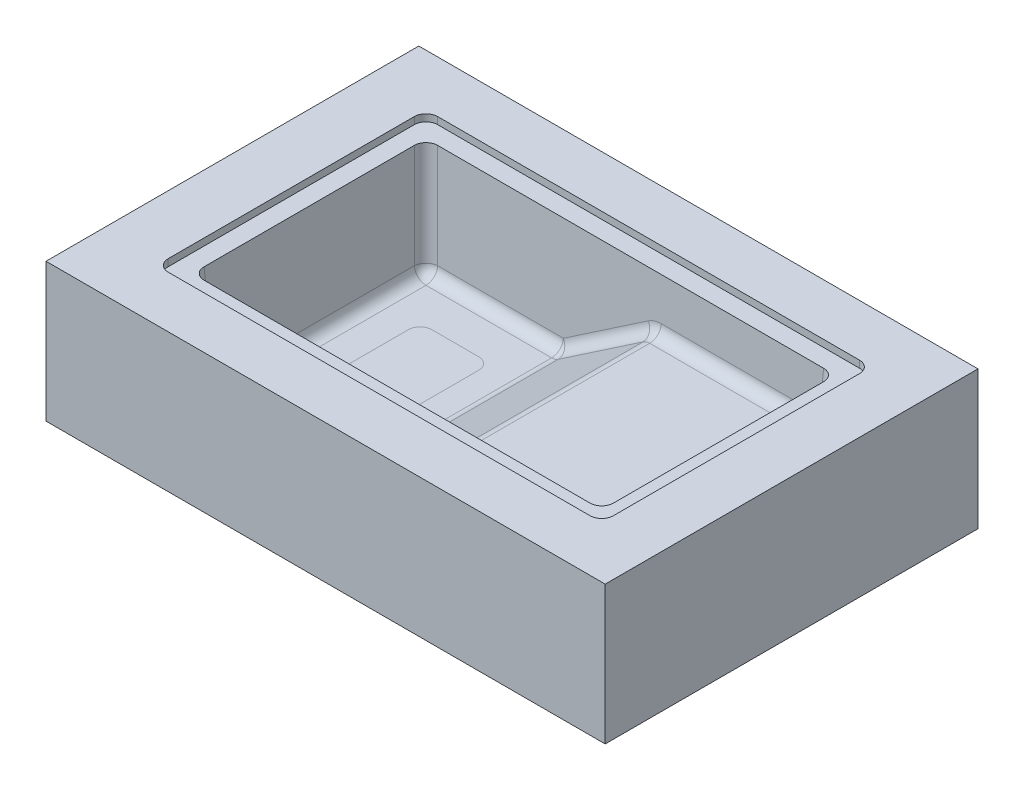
ISO-10303-21;
HEADER;
FILE_DESCRIPTION(('STEP AP214'),'2;1');
FILE_NAME('part.step','',(''),(''),'','','');
FILE_SCHEMA(('AUTOMOTIVE_DESIGN { 1 0 10303 214 1 1 1 1 }'));
ENDSEC;
DATA;
#1=APPLICATION_CONTEXT('core data for automotive mechanical design processes');
#2=APPLICATION_PROTOCOL_DEFINITION('international standard','automotive_design',2000,#1);
#3=PRODUCT_CONTEXT('',#1,'mechanical');
#4=PRODUCT('Part','Part','',(#3));
#5=PRODUCT_RELATED_PRODUCT_CATEGORY('part','',(#4));
#6=PRODUCT_DEFINITION_FORMATION('','',#4);
#7=PRODUCT_DEFINITION_CONTEXT('part definition',#1,'design');
#8=PRODUCT_DEFINITION('design','',#6,#7);
#9=PRODUCT_DEFINITION_SHAPE('','',#8);
#10=(LENGTH_UNIT() NAMED_UNIT(*) SI_UNIT(.MILLI.,.METRE.));
#11=(NAMED_UNIT(*) PLANE_ANGLE_UNIT() SI_UNIT($,.RADIAN.));
#12=(NAMED_UNIT(*) SI_UNIT($,.STERADIAN.) SOLID_ANGLE_UNIT());
#13=UNCERTAINTY_MEASURE_WITH_UNIT(LENGTH_MEASURE(1.E-05),#10,'distance_accuracy_value','');
#14=(GEOMETRIC_REPRESENTATION_CONTEXT(3) GLOBAL_UNCERTAINTY_ASSIGNED_CONTEXT((#13)) GLOBAL_UNIT_ASSIGNED_CONTEXT((#10,
#11,#12)) REPRESENTATION_CONTEXT('',''));
#15=CARTESIAN_POINT('',(0.,0.,0.));
#16=DIRECTION('',(0.,0.,1.));
#17=DIRECTION('',(1.,0.,0.));
#18=AXIS2_PLACEMENT_3D('',#15,#16,#17);
#19=CARTESIAN_POINT('',(-207.256896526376,47.5874487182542,-126.499989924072));
#20=DIRECTION('',(0.,0.,-1.));
#21=DIRECTION('',(-1.,0.,0.));
#22=AXIS2_PLACEMENT_3D('',#19,#20,#21);
#23=PLANE('',#22);
#24=DIRECTION('',(-1.,0.,0.));
#25=VECTOR('',#24,1.);
#26=CARTESIAN_POINT('',(-207.256896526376,54.1874487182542,-126.499989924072));
#27=LINE('',#26,#25);
#28=CARTESIAN_POINT('',(199.743103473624,54.1874487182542,-126.499989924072));
#29=VERTEX_POINT('',#28);
#30=CARTESIAN_POINT('',(-196.256896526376,54.1874487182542,-126.499989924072));
#31=VERTEX_POINT('',#30);
#32=EDGE_CURVE('E513',#29,#31,#27,.T.);
#33=ORIENTED_EDGE('',*,*,#32,.T.);
#34=DIRECTION('',(0.,1.,0.));
#35=VECTOR('',#34,1.);
#36=CARTESIAN_POINT('',(-196.256896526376,47.5874487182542,-126.499989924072));
#37=LINE('',#36,#35);
#38=CARTESIAN_POINT('',(-196.256896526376,47.5874487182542,-126.499989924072));
#39=VERTEX_POINT('',#38);
#40=EDGE_CURVE('E508',#39,#31,#37,.T.);
#41=ORIENTED_EDGE('',*,*,#40,.F.);
#42=DIRECTION('',(-1.,0.,0.));
#43=VECTOR('',#42,1.);
#44=CARTESIAN_POINT('',(-207.256896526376,47.5874487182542,-126.499989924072));
#45=LINE('',#44,#43);
#46=CARTESIAN_POINT('',(199.743103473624,47.5874487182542,-126.499989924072));
#47=VERTEX_POINT('',#46);
#48=EDGE_CURVE('E499',#47,#39,#45,.T.);
#49=ORIENTED_EDGE('',*,*,#48,.F.);
#50=DIRECTION('',(0.,1.,0.));
#51=VECTOR('',#50,1.);
#52=CARTESIAN_POINT('',(199.743103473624,47.5874487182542,-126.499989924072));
#53=LINE('',#52,#51);
#54=EDGE_CURVE('E509',#29,#47,#53,.F.);
#55=ORIENTED_EDGE('',*,*,#54,.F.);
#56=EDGE_LOOP('',(#33,#41,#49,#55));
#57=FACE_BOUND('',#56,.T.);
#58=ADVANCED_FACE('F56',(#57),#23,.F.);
#59=CARTESIAN_POINT('',(-196.256896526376,47.5874487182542,-115.499989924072));
#60=DIRECTION('',(0.,1.,0.));
#61=DIRECTION('',(0.,0.,1.));
#62=AXIS2_PLACEMENT_3D('',#59,#60,#61);
#63=CYLINDRICAL_SURFACE('',#62,11.);
#64=CARTESIAN_POINT('',(-196.256896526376,47.5874487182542,-115.499989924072));
#65=DIRECTION('',(0.,-1.,0.));
#66=DIRECTION('',(0.,0.,-1.));
#67=AXIS2_PLACEMENT_3D('',#64,#65,#66);
#68=CIRCLE('',#67,11.);
#69=CARTESIAN_POINT('',(-207.256896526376,47.5874487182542,-115.499989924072));
#70=VERTEX_POINT('',#69);
#71=EDGE_CURVE('E501',#70,#39,#68,.T.);
#72=ORIENTED_EDGE('',*,*,#71,.T.);
#73=ORIENTED_EDGE('',*,*,#40,.T.);
#74=CARTESIAN_POINT('',(-196.256896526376,54.1874487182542,-115.499989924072));
#75=DIRECTION('',(0.,-1.,0.));
#76=DIRECTION('',(0.,0.,-1.));
#77=AXIS2_PLACEMENT_3D('',#74,#75,#76);
#78=CIRCLE('',#77,11.);
#79=CARTESIAN_POINT('',(-207.256896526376,54.1874487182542,-115.499989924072));
#80=VERTEX_POINT('',#79);
#81=EDGE_CURVE('E624',#31,#80,#78,.F.);
#82=ORIENTED_EDGE('',*,*,#81,.T.);
#83=DIRECTION('',(0.,1.,0.));
#84=VECTOR('',#83,1.);
#85=CARTESIAN_POINT('',(-207.256896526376,47.5874487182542,-115.499989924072));
#86=LINE('',#85,#84);
#87=EDGE_CURVE('E627',#80,#70,#86,.F.);
#88=ORIENTED_EDGE('',*,*,#87,.T.);
#89=EDGE_LOOP('',(#72,#73,#82,#88));
#90=FACE_BOUND('',#89,.T.);
#91=ADVANCED_FACE('F471',(#90),#63,.F.);
#92=CARTESIAN_POINT('',(1.74310347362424,47.5874487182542,1.00759284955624E-05));
#93=DIRECTION('',(0.,-1.,0.));
#94=DIRECTION('',(0.,0.,-1.));
#95=AXIS2_PLACEMENT_3D('',#92,#93,#94);
#96=PLANE('',#95);
#97=DIRECTION('',(0.,0.,1.));
#98=VECTOR('',#97,1.);
#99=CARTESIAN_POINT('',(-190.411005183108,47.5874487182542,110.000010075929));
#100=LINE('',#99,#98);
#101=CARTESIAN_POINT('',(-190.411005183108,47.5874487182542,98.6691938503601));
#102=VERTEX_POINT('',#101);
#103=CARTESIAN_POINT('',(-190.411005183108,47.5874487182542,-98.6691736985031));
#104=VERTEX_POINT('',#103);
#105=EDGE_CURVE('E493',#102,#104,#100,.F.);
#106=ORIENTED_EDGE('',*,*,#105,.T.);
#107=CARTESIAN_POINT('',(-179.395909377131,47.5874487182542,-98.6390027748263));
#108=DIRECTION('',(0.,-1.,0.));
#109=DIRECTION('',(0.707106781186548,0.,0.707106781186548));
#110=AXIS2_PLACEMENT_3D('',#107,#108,#109);
#111=ELLIPSE('',#110,11.0301709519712,11.);
#112=CARTESIAN_POINT('',(-179.426080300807,47.5874487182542,-109.654098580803));
#113=VERTEX_POINT('',#112);
#114=EDGE_CURVE('E564',#113,#104,#111,.F.);
#115=ORIENTED_EDGE('',*,*,#114,.F.);
#116=DIRECTION('',(-1.,0.,0.));
#117=VECTOR('',#116,1.);
#118=CARTESIAN_POINT('',(194.243103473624,47.5874487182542,-109.654098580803));
#119=LINE('',#118,#117);
#120=CARTESIAN_POINT('',(182.912287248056,47.5874487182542,-109.654098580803));
#121=VERTEX_POINT('',#120);
#122=EDGE_CURVE('E579',#113,#121,#119,.F.);
#123=ORIENTED_EDGE('',*,*,#122,.T.);
#124=CARTESIAN_POINT('',(182.882116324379,47.5874487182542,-98.6390027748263));
#125=DIRECTION('',(0.,-1.,0.));
#126=DIRECTION('',(0.707106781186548,0.,-0.707106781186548));
#127=AXIS2_PLACEMENT_3D('',#124,#125,#126);
#128=ELLIPSE('',#127,11.0301709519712,11.);
#129=CARTESIAN_POINT('',(193.897212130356,47.5874487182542,-98.6691736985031));
#130=VERTEX_POINT('',#129);
#131=EDGE_CURVE('E202',#130,#121,#128,.F.);
#132=ORIENTED_EDGE('',*,*,#131,.F.);
#133=DIRECTION('',(0.,0.,-1.));
#134=VECTOR('',#133,1.);
#135=CARTESIAN_POINT('',(193.897212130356,47.5874487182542,110.000010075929));
#136=LINE('',#135,#134);
#137=CARTESIAN_POINT('',(193.897212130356,47.5874487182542,98.6691938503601));
#138=VERTEX_POINT('',#137);
#139=EDGE_CURVE('E582',#130,#138,#136,.F.);
#140=ORIENTED_EDGE('',*,*,#139,.T.);
#141=CARTESIAN_POINT('',(182.882116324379,47.5874487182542,98.6390229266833));
#142=DIRECTION('',(0.,-1.,0.));
#143=DIRECTION('',(0.707106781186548,0.,0.707106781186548));
#144=AXIS2_PLACEMENT_3D('',#141,#142,#143);
#145=ELLIPSE('',#144,11.0301709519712,11.);
#146=CARTESIAN_POINT('',(182.912287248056,47.5874487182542,109.65411873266));
#147=VERTEX_POINT('',#146);
#148=EDGE_CURVE('E801',#147,#138,#145,.F.);
#149=ORIENTED_EDGE('',*,*,#148,.F.);
#150=DIRECTION('',(1.,0.,0.));
#151=VECTOR('',#150,1.);
#152=CARTESIAN_POINT('',(194.243103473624,47.5874487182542,109.65411873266));
#153=LINE('',#152,#151);
#154=CARTESIAN_POINT('',(-179.426080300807,47.5874487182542,109.65411873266));
#155=VERTEX_POINT('',#154);
#156=EDGE_CURVE('E799',#155,#147,#153,.T.);
#157=ORIENTED_EDGE('',*,*,#156,.F.);
#158=CARTESIAN_POINT('',(-179.395909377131,47.5874487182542,98.6390229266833));
#159=DIRECTION('',(0.,-1.,0.));
#160=DIRECTION('',(0.707106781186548,0.,-0.707106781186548));
#161=AXIS2_PLACEMENT_3D('',#158,#159,#160);
#162=ELLIPSE('',#161,11.0301709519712,11.);
#163=EDGE_CURVE('E798',#102,#155,#162,.F.);
#164=ORIENTED_EDGE('',*,*,#163,.F.);
#165=EDGE_LOOP('',(#106,#115,#123,#132,#140,#149,#157,#164));
#166=FACE_BOUND('',#165,.T.);
#167=ORIENTED_EDGE('',*,*,#48,.T.);
#168=ORIENTED_EDGE('',*,*,#71,.F.);
#169=DIRECTION('',(0.,0.,1.));
#170=VECTOR('',#169,1.);
#171=CARTESIAN_POINT('',(-207.256896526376,47.5874487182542,126.500010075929));
#172=LINE('',#171,#170);
#173=CARTESIAN_POINT('',(-207.256896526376,47.5874487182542,115.500010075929));
#174=VERTEX_POINT('',#173);
#175=EDGE_CURVE('E531',#70,#174,#172,.T.);
#176=ORIENTED_EDGE('',*,*,#175,.T.);
#177=CARTESIAN_POINT('',(-196.256896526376,47.5874487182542,115.500010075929));
#178=DIRECTION('',(0.,-1.,0.));
#179=DIRECTION('',(0.,0.,-1.));
#180=AXIS2_PLACEMENT_3D('',#177,#178,#179);
#181=CIRCLE('',#180,11.);
#182=CARTESIAN_POINT('',(-196.256896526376,47.5874487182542,126.500010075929));
#183=VERTEX_POINT('',#182);
#184=EDGE_CURVE('E528',#183,#174,#181,.T.);
#185=ORIENTED_EDGE('',*,*,#184,.F.);
#186=DIRECTION('',(1.,0.,0.));
#187=VECTOR('',#186,1.);
#188=CARTESIAN_POINT('',(-207.256896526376,47.5874487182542,126.500010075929));
#189=LINE('',#188,#187);
#190=CARTESIAN_POINT('',(199.743103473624,47.5874487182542,126.500010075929));
#191=VERTEX_POINT('',#190);
#192=EDGE_CURVE('E532',#183,#191,#189,.T.);
#193=ORIENTED_EDGE('',*,*,#192,.T.);
#194=CARTESIAN_POINT('',(199.743103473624,47.5874487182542,115.500010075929));
#195=DIRECTION('',(0.,-1.,0.));
#196=DIRECTION('',(0.,0.,-1.));
#197=AXIS2_PLACEMENT_3D('',#194,#195,#196);
#198=CIRCLE('',#197,11.);
#199=CARTESIAN_POINT('',(210.743103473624,47.5874487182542,115.500010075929));
#200=VERTEX_POINT('',#199);
#201=EDGE_CURVE('E542',#200,#191,#198,.T.);
#202=ORIENTED_EDGE('',*,*,#201,.F.);
#203=DIRECTION('',(0.,0.,-1.));
#204=VECTOR('',#203,1.);
#205=CARTESIAN_POINT('',(210.743103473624,47.5874487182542,126.500010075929));
#206=LINE('',#205,#204);
#207=CARTESIAN_POINT('',(210.743103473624,47.5874487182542,-115.499989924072));
#208=VERTEX_POINT('',#207);
#209=EDGE_CURVE('E552',#200,#208,#206,.T.);
#210=ORIENTED_EDGE('',*,*,#209,.T.);
#211=CARTESIAN_POINT('',(199.743103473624,47.5874487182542,-115.499989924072));
#212=DIRECTION('',(0.,-1.,0.));
#213=DIRECTION('',(0.,0.,-1.));
#214=AXIS2_PLACEMENT_3D('',#211,#212,#213);
#215=CIRCLE('',#214,11.);
#216=EDGE_CURVE('E504',#47,#208,#215,.T.);
#217=ORIENTED_EDGE('',*,*,#216,.F.);
#218=EDGE_LOOP('',(#167,#168,#176,#185,#193,#202,#210,#217));
#219=FACE_BOUND('',#218,.T.);
#220=ADVANCED_FACE('F477',(#166,#219),#96,.F.);
#221=CARTESIAN_POINT('',(199.743103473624,47.5874487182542,-115.499989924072));
#222=DIRECTION('',(0.,1.,0.));
#223=DIRECTION('',(0.,0.,1.));
#224=AXIS2_PLACEMENT_3D('',#221,#222,#223);
#225=CYLINDRICAL_SURFACE('',#224,11.);
#226=ORIENTED_EDGE('',*,*,#216,.T.);
#227=DIRECTION('',(0.,1.,0.));
#228=VECTOR('',#227,1.);
#229=CARTESIAN_POINT('',(210.743103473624,47.5874487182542,-115.499989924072));
#230=LINE('',#229,#228);
#231=CARTESIAN_POINT('',(210.743103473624,54.1874487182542,-115.499989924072));
#232=VERTEX_POINT('',#231);
#233=EDGE_CURVE('E567',#208,#232,#230,.T.);
#234=ORIENTED_EDGE('',*,*,#233,.T.);
#235=CARTESIAN_POINT('',(199.743103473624,54.1874487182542,-115.499989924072));
#236=DIRECTION('',(0.,-1.,0.));
#237=DIRECTION('',(0.,0.,-1.));
#238=AXIS2_PLACEMENT_3D('',#235,#236,#237);
#239=CIRCLE('',#238,11.);
#240=EDGE_CURVE('E571',#232,#29,#239,.F.);
#241=ORIENTED_EDGE('',*,*,#240,.T.);
#242=ORIENTED_EDGE('',*,*,#54,.T.);
#243=EDGE_LOOP('',(#226,#234,#241,#242));
#244=FACE_BOUND('',#243,.T.);
#245=ADVANCED_FACE('F409',(#244),#225,.F.);
#246=CARTESIAN_POINT('',(0.,54.1874487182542,0.));
#247=DIRECTION('',(0.,1.,0.));
#248=DIRECTION('',(0.,0.,1.));
#249=AXIS2_PLACEMENT_3D('',#246,#247,#248);
#250=PLANE('',#249);
#251=CARTESIAN_POINT('',(-207.256896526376,54.1874487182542,-115.499989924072));
#252=CARTESIAN_POINT('',(-207.256896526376,54.1874487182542,115.500010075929));
#253=B_SPLINE_CURVE_WITH_KNOTS('',1,(#251,#252),.UNSPECIFIED.,.F.,.F.,(2,2),(0.,1.),.UNSPECIFIED.);
#254=CARTESIAN_POINT('',(-207.256896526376,54.1874487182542,115.500010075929));
#255=VERTEX_POINT('',#254);
#256=EDGE_CURVE('E570',#80,#255,#253,.T.);
#257=ORIENTED_EDGE('',*,*,#256,.F.);
#258=ORIENTED_EDGE('',*,*,#81,.F.);
#259=ORIENTED_EDGE('',*,*,#32,.F.);
#260=ORIENTED_EDGE('',*,*,#240,.F.);
#261=CARTESIAN_POINT('',(210.743103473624,54.1874487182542,115.500010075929));
#262=CARTESIAN_POINT('',(210.743103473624,54.1874487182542,-115.499989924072));
#263=B_SPLINE_CURVE_WITH_KNOTS('',1,(#261,#262),.UNSPECIFIED.,.F.,.F.,(2,2),(0.,1.),.UNSPECIFIED.);
#264=CARTESIAN_POINT('',(210.743103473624,54.1874487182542,115.500010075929));
#265=VERTEX_POINT('',#264);
#266=EDGE_CURVE('E525',#265,#232,#263,.T.);
#267=ORIENTED_EDGE('',*,*,#266,.F.);
#268=CARTESIAN_POINT('',(199.743103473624,54.1874487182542,115.500010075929));
#269=DIRECTION('',(0.,1.,0.));
#270=DIRECTION('',(0.,0.,1.));
#271=AXIS2_PLACEMENT_3D('',#268,#269,#270);
#272=CIRCLE('',#271,11.);
#273=CARTESIAN_POINT('',(199.743103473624,54.1874487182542,126.500010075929));
#274=VERTEX_POINT('',#273);
#275=EDGE_CURVE('E596',#274,#265,#272,.T.);
#276=ORIENTED_EDGE('',*,*,#275,.F.);
#277=CARTESIAN_POINT('',(-196.256896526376,54.1874487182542,126.500010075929));
#278=CARTESIAN_POINT('',(199.743103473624,54.1874487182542,126.500010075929));
#279=B_SPLINE_CURVE_WITH_KNOTS('',1,(#277,#278),.UNSPECIFIED.,.F.,.F.,(2,2),(0.,1.),.UNSPECIFIED.);
#280=CARTESIAN_POINT('',(-196.256896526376,54.1874487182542,126.500010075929));
#281=VERTEX_POINT('',#280);
#282=EDGE_CURVE('E601',#281,#274,#279,.T.);
#283=ORIENTED_EDGE('',*,*,#282,.F.);
#284=CARTESIAN_POINT('',(-196.256896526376,54.1874487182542,115.500010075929));
#285=DIRECTION('',(0.,1.,0.));
#286=DIRECTION('',(-1.,0.,0.));
#287=AXIS2_PLACEMENT_3D('',#284,#285,#286);
#288=CIRCLE('',#287,11.);
#289=EDGE_CURVE('E384',#255,#281,#288,.T.);
#290=ORIENTED_EDGE('',*,*,#289,.F.);
#291=EDGE_LOOP('',(#257,#258,#259,#260,#267,#276,#283,#290));
#292=FACE_BOUND('',#291,.T.);
#293=DIRECTION('',(1.,0.,0.));
#294=VECTOR('',#293,1.);
#295=CARTESIAN_POINT('',(0.,54.1874487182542,-175.));
#296=LINE('',#295,#294);
#297=CARTESIAN_POINT('',(-262.5,54.1874487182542,-175.));
#298=VERTEX_POINT('',#297);
#299=CARTESIAN_POINT('',(262.5,54.1874487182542,-175.));
#300=VERTEX_POINT('',#299);
#301=EDGE_CURVE('E821',#298,#300,#296,.T.);
#302=ORIENTED_EDGE('',*,*,#301,.F.);
#303=DIRECTION('',(0.,0.,1.));
#304=VECTOR('',#303,1.);
#305=CARTESIAN_POINT('',(-262.5,54.1874487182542,0.));
#306=LINE('',#305,#304);
#307=CARTESIAN_POINT('',(-262.5,54.1874487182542,175.));
#308=VERTEX_POINT('',#307);
#309=EDGE_CURVE('E810',#298,#308,#306,.T.);
#310=ORIENTED_EDGE('',*,*,#309,.T.);
#311=DIRECTION('',(1.,0.,0.));
#312=VECTOR('',#311,1.);
#313=CARTESIAN_POINT('',(0.,54.1874487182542,175.));
#314=LINE('',#313,#312);
#315=CARTESIAN_POINT('',(262.5,54.1874487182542,175.));
#316=VERTEX_POINT('',#315);
#317=EDGE_CURVE('E833',#308,#316,#314,.T.);
#318=ORIENTED_EDGE('',*,*,#317,.T.);
#319=DIRECTION('',(0.,0.,1.));
#320=VECTOR('',#319,1.);
#321=CARTESIAN_POINT('',(262.5,54.1874487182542,0.));
#322=LINE('',#321,#320);
#323=EDGE_CURVE('E836',#300,#316,#322,.T.);
#324=ORIENTED_EDGE('',*,*,#323,.F.);
#325=EDGE_LOOP('',(#302,#310,#318,#324));
#326=FACE_BOUND('',#325,.T.);
#327=ADVANCED_FACE('F398',(#292,#326),#250,.T.);
#328=CARTESIAN_POINT('',(-207.256896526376,47.5874487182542,126.500010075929));
#329=DIRECTION('',(-1.,0.,0.));
#330=DIRECTION('',(0.,0.,1.));
#331=AXIS2_PLACEMENT_3D('',#328,#329,#330);
#332=PLANE('',#331);
#333=ORIENTED_EDGE('',*,*,#256,.T.);
#334=DIRECTION('',(0.,1.,0.));
#335=VECTOR('',#334,1.);
#336=CARTESIAN_POINT('',(-207.256896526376,47.5874487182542,115.500010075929));
#337=LINE('',#336,#335);
#338=EDGE_CURVE('E521',#174,#255,#337,.T.);
#339=ORIENTED_EDGE('',*,*,#338,.F.);
#340=ORIENTED_EDGE('',*,*,#175,.F.);
#341=ORIENTED_EDGE('',*,*,#87,.F.);
#342=EDGE_LOOP('',(#333,#339,#340,#341));
#343=FACE_BOUND('',#342,.T.);
#344=ADVANCED_FACE('F408',(#343),#332,.F.);
#345=CARTESIAN_POINT('',(-196.256896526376,47.5874487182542,115.500010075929));
#346=DIRECTION('',(0.,1.,0.));
#347=DIRECTION('',(0.,0.,1.));
#348=AXIS2_PLACEMENT_3D('',#345,#346,#347);
#349=CYLINDRICAL_SURFACE('',#348,11.);
#350=ORIENTED_EDGE('',*,*,#184,.T.);
#351=ORIENTED_EDGE('',*,*,#338,.T.);
#352=ORIENTED_EDGE('',*,*,#289,.T.);
#353=DIRECTION('',(0.,1.,0.));
#354=VECTOR('',#353,1.);
#355=CARTESIAN_POINT('',(-196.256896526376,47.5874487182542,126.500010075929));
#356=LINE('',#355,#354);
#357=EDGE_CURVE('E524',#281,#183,#356,.F.);
#358=ORIENTED_EDGE('',*,*,#357,.T.);
#359=EDGE_LOOP('',(#350,#351,#352,#358));
#360=FACE_BOUND('',#359,.T.);
#361=ADVANCED_FACE('F413',(#360),#349,.F.);
#362=CARTESIAN_POINT('',(-207.256896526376,47.5874487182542,126.500010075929));
#363=DIRECTION('',(0.,0.,1.));
#364=DIRECTION('',(1.,0.,0.));
#365=AXIS2_PLACEMENT_3D('',#362,#363,#364);
#366=PLANE('',#365);
#367=ORIENTED_EDGE('',*,*,#282,.T.);
#368=DIRECTION('',(0.,1.,0.));
#369=VECTOR('',#368,1.);
#370=CARTESIAN_POINT('',(199.743103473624,47.5874487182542,126.500010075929));
#371=LINE('',#370,#369);
#372=EDGE_CURVE('E537',#191,#274,#371,.T.);
#373=ORIENTED_EDGE('',*,*,#372,.F.);
#374=ORIENTED_EDGE('',*,*,#192,.F.);
#375=ORIENTED_EDGE('',*,*,#357,.F.);
#376=EDGE_LOOP('',(#367,#373,#374,#375));
#377=FACE_BOUND('',#376,.T.);
#378=ADVANCED_FACE('F418',(#377),#366,.F.);
#379=CARTESIAN_POINT('',(199.743103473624,47.5874487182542,115.500010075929));
#380=DIRECTION('',(0.,1.,0.));
#381=DIRECTION('',(0.,0.,1.));
#382=AXIS2_PLACEMENT_3D('',#379,#380,#381);
#383=CYLINDRICAL_SURFACE('',#382,11.);
#384=ORIENTED_EDGE('',*,*,#201,.T.);
#385=ORIENTED_EDGE('',*,*,#372,.T.);
#386=ORIENTED_EDGE('',*,*,#275,.T.);
#387=DIRECTION('',(0.,1.,0.));
#388=VECTOR('',#387,1.);
#389=CARTESIAN_POINT('',(210.743103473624,47.5874487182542,115.500010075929));
#390=LINE('',#389,#388);
#391=EDGE_CURVE('E547',#265,#200,#390,.F.);
#392=ORIENTED_EDGE('',*,*,#391,.T.);
#393=EDGE_LOOP('',(#384,#385,#386,#392));
#394=FACE_BOUND('',#393,.T.);
#395=ADVANCED_FACE('F421',(#394),#383,.F.);
#396=CARTESIAN_POINT('',(210.743103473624,47.5874487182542,126.500010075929));
#397=DIRECTION('',(1.,0.,0.));
#398=DIRECTION('',(0.,0.,-1.));
#399=AXIS2_PLACEMENT_3D('',#396,#397,#398);
#400=PLANE('',#399);
#401=ORIENTED_EDGE('',*,*,#209,.F.);
#402=ORIENTED_EDGE('',*,*,#391,.F.);
#403=ORIENTED_EDGE('',*,*,#266,.T.);
#404=ORIENTED_EDGE('',*,*,#233,.F.);
#405=EDGE_LOOP('',(#401,#402,#403,#404));
#406=FACE_BOUND('',#405,.T.);
#407=ADVANCED_FACE('F426',(#406),#400,.F.);
#408=CARTESIAN_POINT('',(-179.20103225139,43.8689716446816,-98.4441256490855));
#409=DIRECTION('',(0.052264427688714,-0.997264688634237,0.052264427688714));
#410=DIRECTION('',(0.,-0.0523359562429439,-0.998629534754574));
#411=AXIS2_PLACEMENT_3D('',#408,#409,#410);
#412=CYLINDRICAL_SURFACE('',#411,11.);
#413=ORIENTED_EDGE('',*,*,#114,.T.);
#414=DIRECTION('',(-0.052264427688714,0.997264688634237,-0.0522644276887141));
#415=VECTOR('',#414,1.);
#416=CARTESIAN_POINT('',(-190.18595713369,43.2932761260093,-98.4441256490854));
#417=LINE('',#416,#415);
#418=CARTESIAN_POINT('',(-185.538355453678,-45.3882468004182,-93.7965239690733));
#419=VERTEX_POINT('',#418);
#420=EDGE_CURVE('E203',#104,#419,#417,.F.);
#421=ORIENTED_EDGE('',*,*,#420,.T.);
#422=CARTESIAN_POINT('',(-174.553430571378,-44.8125512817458,-93.7965239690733));
#423=DIRECTION('',(0.0522644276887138,-0.997264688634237,0.0522644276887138));
#424=DIRECTION('',(0.,-0.0523359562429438,-0.998629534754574));
#425=AXIS2_PLACEMENT_3D('',#422,#423,#424);
#426=CIRCLE('',#425,11.);
#427=CARTESIAN_POINT('',(-174.553430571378,-45.3882468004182,-104.781448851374));
#428=VERTEX_POINT('',#427);
#429=EDGE_CURVE('E206',#419,#428,#426,.T.);
#430=ORIENTED_EDGE('',*,*,#429,.T.);
#431=DIRECTION('',(-0.0522644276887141,0.997264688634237,-0.052264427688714));
#432=VECTOR('',#431,1.);
#433=CARTESIAN_POINT('',(-178.750323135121,34.69323387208,-108.978341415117));
#434=LINE('',#433,#432);
#435=EDGE_CURVE('E557',#428,#113,#434,.T.);
#436=ORIENTED_EDGE('',*,*,#435,.T.);
#437=EDGE_LOOP('',(#413,#421,#430,#436));
#438=FACE_BOUND('',#437,.T.);
#439=ADVANCED_FACE('F430',(#438),#412,.F.);
#440=CARTESIAN_POINT('',(194.243103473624,54.1874487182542,-109.999989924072));
#441=DIRECTION('',(0.,-0.0523359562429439,-0.998629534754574));
#442=DIRECTION('',(0.,0.998629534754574,-0.052335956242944));
#443=AXIS2_PLACEMENT_3D('',#440,#441,#442);
#444=PLANE('',#443);
#445=ORIENTED_EDGE('',*,*,#435,.F.);
#446=DIRECTION('',(1.,0.,0.));
#447=VECTOR('',#446,1.);
#448=CARTESIAN_POINT('',(194.243103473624,-45.3882468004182,-104.781448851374));
#449=LINE('',#448,#447);
#450=CARTESIAN_POINT('',(-56.5874285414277,-45.3882468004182,-104.781448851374));
#451=VERTEX_POINT('',#450);
#452=EDGE_CURVE('E214',#451,#428,#449,.F.);
#453=ORIENTED_EDGE('',*,*,#452,.F.);
#454=DIRECTION('',(0.831698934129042,0.554465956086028,-0.0290583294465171));
#455=VECTOR('',#454,1.);
#456=CARTESIAN_POINT('',(162.963176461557,100.978823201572,-112.452221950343));
#457=LINE('',#456,#455);
#458=CARTESIAN_POINT('',(20.3702311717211,5.91685967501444,-107.470235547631));
#459=VERTEX_POINT('',#458);
#460=EDGE_CURVE('E211',#459,#451,#457,.F.);
#461=ORIENTED_EDGE('',*,*,#460,.F.);
#462=CARTESIAN_POINT('',(32.5736354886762,-12.3882468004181,-106.510905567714));
#463=DIRECTION('',(0.,-0.0523359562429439,-0.998629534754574));
#464=DIRECTION('',(0.,-0.998629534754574,0.052335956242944));
#465=AXIS2_PLACEMENT_3D('',#462,#463,#464);
#466=ELLIPSE('',#465,22.0301916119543,22.);
#467=CARTESIAN_POINT('',(32.5736354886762,9.6117531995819,-107.663876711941));
#468=VERTEX_POINT('',#467);
#469=EDGE_CURVE('E197',#459,#468,#466,.T.);
#470=ORIENTED_EDGE('',*,*,#469,.T.);
#471=DIRECTION('',(1.,0.,0.));
#472=VECTOR('',#471,1.);
#473=CARTESIAN_POINT('',(194.243103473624,9.6117531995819,-107.663876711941));
#474=LINE('',#473,#472);
#475=CARTESIAN_POINT('',(180.922065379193,9.6117531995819,-107.663876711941));
#476=VERTEX_POINT('',#475);
#477=EDGE_CURVE('E169',#476,#468,#474,.F.);
#478=ORIENTED_EDGE('',*,*,#477,.F.);
#479=DIRECTION('',(-0.0522644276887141,-0.997264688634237,0.052264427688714));
#480=VECTOR('',#479,1.);
#481=CARTESIAN_POINT('',(183.288184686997,54.7599991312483,-110.029996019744));
#482=LINE('',#481,#480);
#483=EDGE_CURVE('E193',#121,#476,#482,.T.);
#484=ORIENTED_EDGE('',*,*,#483,.F.);
#485=ORIENTED_EDGE('',*,*,#122,.F.);
#486=EDGE_LOOP('',(#445,#453,#461,#470,#478,#484,#485));
#487=FACE_BOUND('',#486,.T.);
#488=ADVANCED_FACE('F191',(#487),#444,.F.);
#489=CARTESIAN_POINT('',(182.687239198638,43.8689716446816,-98.4441256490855));
#490=DIRECTION('',(0.052264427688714,0.997264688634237,-0.052264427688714));
#491=DIRECTION('',(0.,0.0523359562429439,0.998629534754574));
#492=AXIS2_PLACEMENT_3D('',#489,#490,#491);
#493=CYLINDRICAL_SURFACE('',#492,11.);
#494=ORIENTED_EDGE('',*,*,#131,.T.);
#495=ORIENTED_EDGE('',*,*,#483,.T.);
#496=CARTESIAN_POINT('',(180.922065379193,10.1874487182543,-96.6789518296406));
#497=DIRECTION('',(-0.0522644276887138,-0.997264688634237,0.052264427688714));
#498=DIRECTION('',(0.,-0.0523359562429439,-0.998629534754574));
#499=AXIS2_PLACEMENT_3D('',#496,#497,#498);
#500=CIRCLE('',#499,11.);
#501=CARTESIAN_POINT('',(191.906990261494,9.6117531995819,-96.6789518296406));
#502=VERTEX_POINT('',#501);
#503=EDGE_CURVE('E177',#476,#502,#500,.T.);
#504=ORIENTED_EDGE('',*,*,#503,.T.);
#505=DIRECTION('',(-0.052264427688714,-0.997264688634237,0.0522644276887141));
#506=VECTOR('',#505,1.);
#507=CARTESIAN_POINT('',(193.672164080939,43.2932761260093,-98.4441256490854));
#508=LINE('',#507,#506);
#509=EDGE_CURVE('E186',#502,#130,#508,.F.);
#510=ORIENTED_EDGE('',*,*,#509,.T.);
#511=EDGE_LOOP('',(#494,#495,#504,#510));
#512=FACE_BOUND('',#511,.T.);
#513=ADVANCED_FACE('F200',(#512),#493,.F.);
#514=CARTESIAN_POINT('',(194.243103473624,54.1874487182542,110.000010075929));
#515=DIRECTION('',(0.998629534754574,-0.0523359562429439,0.));
#516=DIRECTION('',(0.052335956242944,0.998629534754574,0.));
#517=AXIS2_PLACEMENT_3D('',#514,#515,#516);
#518=PLANE('',#517);
#519=ORIENTED_EDGE('',*,*,#509,.F.);
#520=DIRECTION('',(0.,0.,-1.));
#521=VECTOR('',#520,1.);
#522=CARTESIAN_POINT('',(191.906990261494,9.6117531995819,110.000010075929));
#523=LINE('',#522,#521);
#524=CARTESIAN_POINT('',(191.906990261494,9.6117531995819,96.6789719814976));
#525=VERTEX_POINT('',#524);
#526=EDGE_CURVE('E220',#525,#502,#523,.T.);
#527=ORIENTED_EDGE('',*,*,#526,.F.);
#528=DIRECTION('',(0.052264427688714,0.997264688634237,0.0522644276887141));
#529=VECTOR('',#528,1.);
#530=CARTESIAN_POINT('',(191.39068170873,-0.240000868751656,96.1626634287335));
#531=LINE('',#530,#529);
#532=EDGE_CURVE('E185',#138,#525,#531,.F.);
#533=ORIENTED_EDGE('',*,*,#532,.F.);
#534=ORIENTED_EDGE('',*,*,#139,.F.);
#535=EDGE_LOOP('',(#519,#527,#533,#534));
#536=FACE_BOUND('',#535,.T.);
#537=ADVANCED_FACE('F439',(#536),#518,.F.);
#538=CARTESIAN_POINT('',(183.288184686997,55.3356946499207,99.0450912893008));
#539=DIRECTION('',(0.052264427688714,0.997264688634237,0.052264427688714));
#540=DIRECTION('',(0.,-0.0523359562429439,0.998629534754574));
#541=AXIS2_PLACEMENT_3D('',#538,#539,#540);
#542=CYLINDRICAL_SURFACE('',#541,11.);
#543=ORIENTED_EDGE('',*,*,#148,.T.);
#544=ORIENTED_EDGE('',*,*,#532,.T.);
#545=CARTESIAN_POINT('',(180.922065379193,10.1874487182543,96.6789719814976));
#546=DIRECTION('',(-0.0522644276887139,-0.997264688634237,-0.052264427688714));
#547=DIRECTION('',(0.,0.0523359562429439,-0.998629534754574));
#548=AXIS2_PLACEMENT_3D('',#545,#546,#547);
#549=CIRCLE('',#548,11.);
#550=CARTESIAN_POINT('',(180.922065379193,9.6117531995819,107.663896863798));
#551=VERTEX_POINT('',#550);
#552=EDGE_CURVE('E224',#525,#551,#549,.T.);
#553=ORIENTED_EDGE('',*,*,#552,.T.);
#554=DIRECTION('',(-0.0522644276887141,-0.997264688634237,-0.052264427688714));
#555=VECTOR('',#554,1.);
#556=CARTESIAN_POINT('',(183.288184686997,54.7599991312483,110.030016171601));
#557=LINE('',#556,#555);
#558=EDGE_CURVE('E222',#551,#147,#557,.F.);
#559=ORIENTED_EDGE('',*,*,#558,.T.);
#560=EDGE_LOOP('',(#543,#544,#553,#559));
#561=FACE_BOUND('',#560,.T.);
#562=ADVANCED_FACE('F442',(#561),#542,.F.);
#563=CARTESIAN_POINT('',(194.243103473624,54.1874487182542,110.000010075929));
#564=DIRECTION('',(0.,-0.0523359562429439,0.998629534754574));
#565=DIRECTION('',(0.,-0.998629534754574,-0.052335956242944));
#566=AXIS2_PLACEMENT_3D('',#563,#564,#565);
#567=PLANE('',#566);
#568=ORIENTED_EDGE('',*,*,#156,.T.);
#569=ORIENTED_EDGE('',*,*,#558,.F.);
#570=DIRECTION('',(1.,0.,0.));
#571=VECTOR('',#570,1.);
#572=CARTESIAN_POINT('',(191.360675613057,9.6117531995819,107.663896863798));
#573=LINE('',#572,#571);
#574=CARTESIAN_POINT('',(32.5736354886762,9.6117531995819,107.663896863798));
#575=VERTEX_POINT('',#574);
#576=EDGE_CURVE('E239',#575,#551,#573,.T.);
#577=ORIENTED_EDGE('',*,*,#576,.F.);
#578=CARTESIAN_POINT('',(32.5736354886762,-12.3882468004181,106.510925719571));
#579=DIRECTION('',(0.,-0.0523359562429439,0.998629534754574));
#580=DIRECTION('',(0.,0.998629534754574,0.052335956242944));
#581=AXIS2_PLACEMENT_3D('',#578,#579,#580);
#582=ELLIPSE('',#581,22.0301916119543,22.);
#583=CARTESIAN_POINT('',(20.3702311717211,5.91685967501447,107.470255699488));
#584=VERTEX_POINT('',#583);
#585=EDGE_CURVE('E236',#575,#584,#582,.T.);
#586=ORIENTED_EDGE('',*,*,#585,.T.);
#587=DIRECTION('',(0.831698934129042,0.554465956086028,0.0290583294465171));
#588=VECTOR('',#587,1.);
#589=CARTESIAN_POINT('',(23.3960193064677,7.93405176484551,107.575972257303));
#590=LINE('',#589,#588);
#591=CARTESIAN_POINT('',(-56.5874285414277,-45.3882468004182,104.781469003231));
#592=VERTEX_POINT('',#591);
#593=EDGE_CURVE('E233',#592,#584,#590,.T.);
#594=ORIENTED_EDGE('',*,*,#593,.F.);
#595=DIRECTION('',(1.,0.,0.));
#596=VECTOR('',#595,1.);
#597=CARTESIAN_POINT('',(-53.2568965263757,-45.3882468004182,104.781469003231));
#598=LINE('',#597,#596);
#599=CARTESIAN_POINT('',(-174.553430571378,-45.3882468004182,104.781469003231));
#600=VERTEX_POINT('',#599);
#601=EDGE_CURVE('E230',#600,#592,#598,.T.);
#602=ORIENTED_EDGE('',*,*,#601,.F.);
#603=DIRECTION('',(-0.0522644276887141,0.997264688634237,0.052264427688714));
#604=VECTOR('',#603,1.);
#605=CARTESIAN_POINT('',(-174.037122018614,-55.2400008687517,104.265160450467));
#606=LINE('',#605,#604);
#607=EDGE_CURVE('E227',#155,#600,#606,.F.);
#608=ORIENTED_EDGE('',*,*,#607,.F.);
#609=EDGE_LOOP('',(#568,#569,#577,#586,#594,#602,#608));
#610=FACE_BOUND('',#609,.T.);
#611=ADVANCED_FACE('F446',(#610),#567,.F.);
#612=CARTESIAN_POINT('',(-178.750323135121,35.2689293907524,97.9934366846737));
#613=DIRECTION('',(0.052264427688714,-0.997264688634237,-0.052264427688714));
#614=DIRECTION('',(0.,0.0523359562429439,-0.998629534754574));
#615=AXIS2_PLACEMENT_3D('',#612,#613,#614);
#616=CYLINDRICAL_SURFACE('',#615,11.);
#617=ORIENTED_EDGE('',*,*,#163,.T.);
#618=ORIENTED_EDGE('',*,*,#607,.T.);
#619=CARTESIAN_POINT('',(-174.553430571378,-44.8125512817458,93.7965441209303));
#620=DIRECTION('',(0.0522644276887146,-0.997264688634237,-0.0522644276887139));
#621=DIRECTION('',(0.998629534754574,0.0523359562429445,0.));
#622=AXIS2_PLACEMENT_3D('',#619,#620,#621);
#623=CIRCLE('',#622,11.);
#624=CARTESIAN_POINT('',(-185.538355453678,-45.3882468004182,93.7965441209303));
#625=VERTEX_POINT('',#624);
#626=EDGE_CURVE('E244',#600,#625,#623,.T.);
#627=ORIENTED_EDGE('',*,*,#626,.T.);
#628=DIRECTION('',(0.052264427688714,-0.997264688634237,-0.0522644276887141));
#629=VECTOR('',#628,1.);
#630=CARTESIAN_POINT('',(-190.786902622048,54.7599991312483,99.0450912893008));
#631=LINE('',#630,#629);
#632=EDGE_CURVE('E242',#625,#102,#631,.F.);
#633=ORIENTED_EDGE('',*,*,#632,.T.);
#634=EDGE_LOOP('',(#617,#618,#627,#633));
#635=FACE_BOUND('',#634,.T.);
#636=ADVANCED_FACE('F450',(#635),#616,.F.);
#637=CARTESIAN_POINT('',(-190.756896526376,54.1874487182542,110.000010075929));
#638=DIRECTION('',(-0.998629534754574,-0.0523359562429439,0.));
#639=DIRECTION('',(0.052335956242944,-0.998629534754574,0.));
#640=AXIS2_PLACEMENT_3D('',#637,#638,#639);
#641=PLANE('',#640);
#642=ORIENTED_EDGE('',*,*,#632,.F.);
#643=DIRECTION('',(0.,0.,-1.));
#644=VECTOR('',#643,1.);
#645=CARTESIAN_POINT('',(-185.538355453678,-45.3882468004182,110.000010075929));
#646=LINE('',#645,#644);
#647=EDGE_CURVE('E247',#419,#625,#646,.F.);
#648=ORIENTED_EDGE('',*,*,#647,.F.);
#649=ORIENTED_EDGE('',*,*,#420,.F.);
#650=ORIENTED_EDGE('',*,*,#105,.F.);
#651=EDGE_LOOP('',(#642,#648,#649,#650));
#652=FACE_BOUND('',#651,.T.);
#653=ADVANCED_FACE('F454',(#652),#641,.F.);
#654=CARTESIAN_POINT('',(-174.553430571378,-44.8125512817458,-93.7965239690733));
#655=DIRECTION('',(0.,0.,1.));
#656=DIRECTION('',(1.,0.,0.));
#657=AXIS2_PLACEMENT_3D('',#654,#655,#656);
#658=SPHERICAL_SURFACE('',#657,11.);
#659=CARTESIAN_POINT('',(-174.553430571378,-44.8125512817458,-93.7965239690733));
#660=DIRECTION('',(0.,0.,-1.));
#661=DIRECTION('',(-1.,0.,0.));
#662=AXIS2_PLACEMENT_3D('',#659,#660,#661);
#663=CIRCLE('',#662,11.);
#664=CARTESIAN_POINT('',(-174.553430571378,-55.8125512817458,-93.7965239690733));
#665=VERTEX_POINT('',#664);
#666=EDGE_CURVE('E250',#665,#419,#663,.T.);
#667=ORIENTED_EDGE('',*,*,#666,.F.);
#668=CARTESIAN_POINT('',(-174.553430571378,-44.8125512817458,-93.7965239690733));
#669=DIRECTION('',(-1.,0.,0.));
#670=DIRECTION('',(0.,0.,1.));
#671=AXIS2_PLACEMENT_3D('',#668,#669,#670);
#672=CIRCLE('',#671,11.);
#673=EDGE_CURVE('E253',#665,#428,#672,.F.);
#674=ORIENTED_EDGE('',*,*,#673,.T.);
#675=ORIENTED_EDGE('',*,*,#429,.F.);
#676=EDGE_LOOP('',(#667,#674,#675));
#677=FACE_BOUND('',#676,.T.);
#678=ADVANCED_FACE('F458',(#677),#658,.F.);
#679=CARTESIAN_POINT('',(-190.756896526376,-44.8125512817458,-93.7965239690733));
#680=DIRECTION('',(-1.,0.,0.));
#681=DIRECTION('',(0.,0.,1.));
#682=AXIS2_PLACEMENT_3D('',#679,#680,#681);
#683=CYLINDRICAL_SURFACE('',#682,11.);
#684=ORIENTED_EDGE('',*,*,#673,.F.);
#685=DIRECTION('',(-1.,0.,0.));
#686=VECTOR('',#685,1.);
#687=CARTESIAN_POINT('',(-190.756896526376,-55.8125512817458,-93.7965239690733));
#688=LINE('',#687,#686);
#689=CARTESIAN_POINT('',(-56.5874285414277,-55.8125512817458,-93.7965239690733));
#690=VERTEX_POINT('',#689);
#691=EDGE_CURVE('E257',#665,#690,#688,.F.);
#692=ORIENTED_EDGE('',*,*,#691,.T.);
#693=CARTESIAN_POINT('',(-56.5874285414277,-44.8125512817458,-93.7965239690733));
#694=DIRECTION('',(1.,0.,0.));
#695=DIRECTION('',(0.,0.,-1.));
#696=AXIS2_PLACEMENT_3D('',#693,#694,#695);
#697=CIRCLE('',#696,11.);
#698=EDGE_CURVE('E255',#690,#451,#697,.T.);
#699=ORIENTED_EDGE('',*,*,#698,.T.);
#700=ORIENTED_EDGE('',*,*,#452,.T.);
#701=EDGE_LOOP('',(#684,#692,#699,#700));
#702=FACE_BOUND('',#701,.T.);
#703=ADVANCED_FACE('F461',(#702),#683,.F.);
#704=CARTESIAN_POINT('',(-64.2815688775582,-49.9419781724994,-93.5277020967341));
#705=DIRECTION('',(-0.831698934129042,-0.554465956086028,0.0290583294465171));
#706=DIRECTION('',(0.554700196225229,-0.832050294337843,0.));
#707=AXIS2_PLACEMENT_3D('',#704,#705,#706);
#708=CYLINDRICAL_SURFACE('',#707,11.);
#709=CARTESIAN_POINT('',(-56.5874285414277,-44.8125512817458,-93.7965239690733));
#710=DIRECTION('',(-0.831698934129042,-0.554465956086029,0.029058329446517));
#711=DIRECTION('',(0.55470019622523,-0.832050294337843,0.));
#712=AXIS2_PLACEMENT_3D('',#709,#710,#711);
#713=CIRCLE('',#712,11.);
#714=CARTESIAN_POINT('',(-50.4857263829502,-53.9651045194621,-93.7965239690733));
#715=VERTEX_POINT('',#714);
#716=EDGE_CURVE('E260',#715,#451,#713,.F.);
#717=ORIENTED_EDGE('',*,*,#716,.F.);
#718=DIRECTION('',(-0.831698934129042,-0.554465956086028,0.0290583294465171));
#719=VECTOR('',#718,1.);
#720=CARTESIAN_POINT('',(-58.1798667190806,-59.0945314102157,-93.5277020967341));
#721=LINE('',#720,#719);
#722=CARTESIAN_POINT('',(26.4719333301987,-2.65999804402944,-96.4853106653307));
#723=VERTEX_POINT('',#722);
#724=EDGE_CURVE('E266',#715,#723,#721,.F.);
#725=ORIENTED_EDGE('',*,*,#724,.T.);
#726=CARTESIAN_POINT('',(20.3702311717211,6.49255519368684,-96.4853106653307));
#727=DIRECTION('',(0.831698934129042,0.554465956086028,-0.029058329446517));
#728=DIRECTION('',(-0.554700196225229,0.832050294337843,0.));
#729=AXIS2_PLACEMENT_3D('',#726,#727,#728);
#730=CIRCLE('',#729,11.);
#731=EDGE_CURVE('E263',#459,#723,#730,.F.);
#732=ORIENTED_EDGE('',*,*,#731,.F.);
#733=ORIENTED_EDGE('',*,*,#460,.T.);
#734=EDGE_LOOP('',(#717,#725,#732,#733));
#735=FACE_BOUND('',#734,.T.);
#736=ADVANCED_FACE('F279',(#735),#708,.F.);
#737=CARTESIAN_POINT('',(32.5736354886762,-34.3882468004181,-105.357934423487));
#738=CARTESIAN_POINT('',(32.5736354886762,-22.8125512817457,-105.964590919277));
#739=CARTESIAN_POINT('',(32.5736354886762,-22.8125512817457,-94.3730095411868));
#740=CARTESIAN_POINT('',(31.6136985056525,-34.3882468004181,-105.357934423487));
#741=CARTESIAN_POINT('',(32.1201728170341,-22.8125512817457,-105.964590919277));
#742=CARTESIAN_POINT('',(32.0936669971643,-22.8125512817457,-94.3730095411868));
#743=CARTESIAN_POINT('',(30.6537615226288,-34.3253277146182,-105.361231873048));
#744=CARTESIAN_POINT('',(31.6667817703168,-22.7845919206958,-105.9660562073));
#745=CARTESIAN_POINT('',(31.6136985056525,-22.7810917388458,-94.376306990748));
#746=CARTESIAN_POINT('',(28.75031284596,-34.0747339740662,-105.374364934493));
#747=CARTESIAN_POINT('',(30.7661891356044,-22.673002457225,-105.971904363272));
#748=CARTESIAN_POINT('',(30.6619741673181,-22.6557948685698,-94.3894400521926));
#749=CARTESIAN_POINT('',(27.8068019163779,-33.8870535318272,-105.384200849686));
#750=CARTESIAN_POINT('',(30.3191267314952,-22.5894047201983,-105.976285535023));
#751=CARTESIAN_POINT('',(30.1902187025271,-22.5619546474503,-94.3992759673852));
#752=CARTESIAN_POINT('',(25.9523479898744,-33.3901541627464,-105.410242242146));
#753=CARTESIAN_POINT('',(29.4375341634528,-22.3673604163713,-105.987922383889));
#754=CARTESIAN_POINT('',(29.2629917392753,-22.3135049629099,-94.4253173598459));
#755=CARTESIAN_POINT('',(25.0414079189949,-33.0809243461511,-105.426448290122));
#756=CARTESIAN_POINT('',(29.0031311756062,-22.2289767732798,-105.995174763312));
#757=CARTESIAN_POINT('',(28.8075217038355,-22.1588900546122,-94.4415234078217));
#758=CARTESIAN_POINT('',(23.2676796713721,-32.3462221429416,-105.464952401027));
#759=CARTESIAN_POINT('',(28.153202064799,-21.8987907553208,-106.012479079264));
#760=CARTESIAN_POINT('',(27.9206575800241,-21.7915389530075,-94.4800275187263));
#761=CARTESIAN_POINT('',(22.4048976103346,-31.9207350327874,-105.487251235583));
#762=CARTESIAN_POINT('',(27.7377837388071,-21.7070783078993,-106.022526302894));
#763=CARTESIAN_POINT('',(27.4892665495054,-21.5787953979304,-94.5023263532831));
#764=CARTESIAN_POINT('',(20.7422444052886,-30.9608018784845,-105.537559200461));
#765=CARTESIAN_POINT('',(26.9321434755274,-21.2723230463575,-106.045310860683));
#766=CARTESIAN_POINT('',(26.6579399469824,-21.0988288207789,-94.5526343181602));
#767=CARTESIAN_POINT('',(19.9423830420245,-30.4263389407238,-105.565569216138));
#768=CARTESIAN_POINT('',(26.5420035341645,-21.0293919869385,-106.058042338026));
#769=CARTESIAN_POINT('',(26.2580092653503,-20.8315973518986,-94.5806443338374));
#770=CARTESIAN_POINT('',(18.4192533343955,-29.2576005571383,-105.626820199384));
#771=CARTESIAN_POINT('',(25.7931625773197,-20.4950041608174,-106.086048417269));
#772=CARTESIAN_POINT('',(25.4964444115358,-20.2472281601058,-94.6418953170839));
#773=CARTESIAN_POINT('',(17.6959982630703,-28.6233078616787,-105.660062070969));
#774=CARTESIAN_POINT('',(25.4345126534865,-20.2036743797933,-106.101316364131));
#775=CARTESIAN_POINT('',(25.1348168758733,-19.930081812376,-94.6751371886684));
#776=CARTESIAN_POINT('',(16.3384528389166,-27.2657626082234,-105.731208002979));
#777=CARTESIAN_POINT('',(24.7547372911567,-19.5760664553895,-106.13420790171));
#778=CARTESIAN_POINT('',(24.4560441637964,-19.2513091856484,-94.7462831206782));
#779=CARTESIAN_POINT('',(15.7041784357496,-26.5424941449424,-105.769112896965));
#780=CARTESIAN_POINT('',(24.4336285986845,-19.2399228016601,-106.151824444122));
#781=CARTESIAN_POINT('',(24.1389069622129,-18.8896749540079,-94.7841880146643));
#782=CARTESIAN_POINT('',(14.5354445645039,-25.0193707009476,-105.848936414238));
#783=CARTESIAN_POINT('',(23.8347564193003,-18.527081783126,-106.189182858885));
#784=CARTESIAN_POINT('',(23.55454002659,-18.1281132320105,-94.864011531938));
#785=CARTESIAN_POINT('',(14.0010023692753,-24.2195025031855,-105.890855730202));
#786=CARTESIAN_POINT('',(23.556973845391,-18.1505179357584,-106.208917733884));
#787=CARTESIAN_POINT('',(23.2873189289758,-17.7281791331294,-94.9059308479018));
#788=CARTESIAN_POINT('',(13.0410764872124,-22.5568623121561,-105.977991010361));
#789=CARTESIAN_POINT('',(23.0501775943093,-17.3620718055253,-106.250238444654));
#790=CARTESIAN_POINT('',(22.8073559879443,-16.8968590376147,-94.9930661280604));
#791=CARTESIAN_POINT('',(12.6156096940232,-21.6940805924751,-106.023207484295));
#792=CARTESIAN_POINT('',(22.8211096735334,-16.9503133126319,-106.271817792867));
#793=CARTESIAN_POINT('',(22.5946225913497,-16.4654681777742,-95.0382826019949));
#794=CARTESIAN_POINT('',(11.8809154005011,-19.9203718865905,-106.116163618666));
#795=CARTESIAN_POINT('',(22.4166192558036,-16.0975478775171,-106.316509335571));
#796=CARTESIAN_POINT('',(22.2272754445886,-15.5786138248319,-95.1312387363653));
#797=CARTESIAN_POINT('',(11.5717026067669,-19.0094388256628,-106.163903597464));
#798=CARTESIAN_POINT('',(22.2411102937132,-15.6566465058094,-106.339615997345));
#799=CARTESIAN_POINT('',(22.0726690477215,-15.1231472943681,-95.178978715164));
#800=CARTESIAN_POINT('',(11.0748098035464,-17.1550098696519,-106.261090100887));
#801=CARTESIAN_POINT('',(21.9479075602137,-14.7524592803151,-106.387002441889));
#802=CARTESIAN_POINT('',(21.8242226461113,-14.1959328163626,-95.2761652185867));
#803=CARTESIAN_POINT('',(10.8871406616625,-16.2115110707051,-106.310536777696));
#804=CARTESIAN_POINT('',(21.83010024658,-14.2892531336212,-106.411278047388));
#805=CARTESIAN_POINT('',(21.7303880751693,-13.7241834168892,-95.3256118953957));
#806=CARTESIAN_POINT('',(10.6365506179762,-14.3080909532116,-106.410290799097));
#807=CARTESIAN_POINT('',(21.6556044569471,-13.3480359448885,-106.460605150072));
#808=CARTESIAN_POINT('',(21.6050930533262,-12.7724733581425,-95.4253659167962));
#809=CARTESIAN_POINT('',(10.5736354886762,-13.3481688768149,-106.460598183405));
#810=CARTESIAN_POINT('',(21.5987825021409,-12.8700725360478,-106.485654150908));
#811=CARTESIAN_POINT('',(21.5736354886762,-12.2925123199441,-95.4756733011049));
#812=CARTESIAN_POINT('',(10.5736354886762,-11.4283247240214,-106.561212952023));
#813=CARTESIAN_POINT('',(21.5485458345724,-11.9075200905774,-106.536099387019));
#814=CARTESIAN_POINT('',(21.5736354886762,-11.3325902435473,-95.5762880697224));
#815=CARTESIAN_POINT('',(10.6365506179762,-10.4684026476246,-106.611520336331));
#816=CARTESIAN_POINT('',(21.5549864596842,-11.4229423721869,-106.56149502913));
#817=CARTESIAN_POINT('',(21.6050930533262,-10.852629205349,-95.6265954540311));
#818=CARTESIAN_POINT('',(10.8871406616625,-8.56498253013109,-106.711274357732));
#819=CARTESIAN_POINT('',(21.6324187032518,-10.4557894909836,-106.612181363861));
#820=CARTESIAN_POINT('',(21.7303880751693,-9.90091914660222,-95.7263494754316));
#821=CARTESIAN_POINT('',(11.0748098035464,-7.62148373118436,-106.760721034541));
#822=CARTESIAN_POINT('',(21.7032643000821,-9.973187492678,-106.637473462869));
#823=CARTESIAN_POINT('',(21.8242226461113,-9.42916974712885,-95.7757961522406));
#824=CARTESIAN_POINT('',(11.5717026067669,-5.76705477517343,-106.857907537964));
#825=CARTESIAN_POINT('',(21.9094041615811,-9.01888261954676,-106.687486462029));
#826=CARTESIAN_POINT('',(22.0726690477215,-8.50195526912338,-95.8729826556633));
#827=CARTESIAN_POINT('',(11.8809154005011,-4.85612171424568,-106.905647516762));
#828=CARTESIAN_POINT('',(22.0445612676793,-8.54711559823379,-106.712210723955));
#829=CARTESIAN_POINT('',(22.2272754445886,-8.04648873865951,-95.920722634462));
#830=CARTESIAN_POINT('',(12.6156096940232,-3.08241300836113,-106.998603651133));
#831=CARTESIAN_POINT('',(22.3779088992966,-7.62344218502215,-106.760618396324));
#832=CARTESIAN_POINT('',(22.5946225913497,-7.15963438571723,-96.0136787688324));
#833=CARTESIAN_POINT('',(13.0410764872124,-2.21963128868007,-107.043820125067));
#834=CARTESIAN_POINT('',(22.5759809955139,-7.17143794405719,-106.78430693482));
#835=CARTESIAN_POINT('',(22.8073559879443,-6.72824352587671,-96.058895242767));
#836=CARTESIAN_POINT('',(14.0010023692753,-0.556991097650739,-107.130955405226));
#837=CARTESIAN_POINT('',(23.0324027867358,-6.29609824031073,-106.830181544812));
#838=CARTESIAN_POINT('',(23.2873189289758,-5.89692343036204,-96.1460305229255));
#839=CARTESIAN_POINT('',(14.5354445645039,0.242877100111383,-107.17287472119));
#840=CARTESIAN_POINT('',(23.2906615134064,-5.87263746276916,-106.852374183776));
#841=CARTESIAN_POINT('',(23.55454002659,-5.49698933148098,-96.1879498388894));
#842=CARTESIAN_POINT('',(15.7041784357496,1.76600054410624,-107.252698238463));
#843=CARTESIAN_POINT('',(23.8633742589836,-5.06281504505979,-106.894815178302));
#844=CARTESIAN_POINT('',(24.1389069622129,-4.73542760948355,-96.2677733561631));
#845=CARTESIAN_POINT('',(16.3384528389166,2.48926900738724,-107.290603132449));
#846=CARTESIAN_POINT('',(24.1777716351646,-4.67630912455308,-106.915071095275));
#847=CARTESIAN_POINT('',(24.4560441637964,-4.37379337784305,-96.3056782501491));
#848=CARTESIAN_POINT('',(17.6959982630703,3.84681426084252,-107.361749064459));
#849=CARTESIAN_POINT('',(24.8574092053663,-3.94822725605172,-106.95322824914));
#850=CARTESIAN_POINT('',(25.1348168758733,-3.69502075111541,-96.3768241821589));
#851=CARTESIAN_POINT('',(18.4192533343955,4.48110695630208,-107.394990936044));
#852=CARTESIAN_POINT('',(25.2226314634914,-3.60649824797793,-106.971137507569));
#853=CARTESIAN_POINT('',(25.4964444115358,-3.37787440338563,-96.4100660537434));
#854=CARTESIAN_POINT('',(19.9423830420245,5.64984533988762,-107.45624191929));
#855=CARTESIAN_POINT('',(25.9973933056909,-2.97499099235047,-107.004233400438));
#856=CARTESIAN_POINT('',(26.2580092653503,-2.79350521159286,-96.47131703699));
#857=CARTESIAN_POINT('',(20.7422444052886,6.18430827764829,-107.484251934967));
#858=CARTESIAN_POINT('',(26.4069551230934,-2.6850620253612,-107.019427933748));
#859=CARTESIAN_POINT('',(26.6579399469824,-2.52627374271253,-96.4993270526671));
#860=CARTESIAN_POINT('',(22.4048976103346,7.14424143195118,-107.534559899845));
#861=CARTESIAN_POINT('',(27.2628324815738,-2.16317411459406,-107.046778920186));
#862=CARTESIAN_POINT('',(27.4892665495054,-2.04630716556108,-96.5496350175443));
#863=CARTESIAN_POINT('',(23.2676796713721,7.56972854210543,-107.556858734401));
#864=CARTESIAN_POINT('',(27.7092087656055,-1.93107798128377,-107.058942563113));
#865=CARTESIAN_POINT('',(27.9206575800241,-1.83356361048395,-96.571933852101));
#866=CARTESIAN_POINT('',(25.0414079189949,8.3044307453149,-107.595362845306));
#867=CARTESIAN_POINT('',(28.6302815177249,-1.52970792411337,-107.07997747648));
#868=CARTESIAN_POINT('',(28.8075217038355,-1.46621250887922,-96.6104379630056));
#869=CARTESIAN_POINT('',(25.9523479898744,8.61366056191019,-107.611568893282));
#870=CARTESIAN_POINT('',(29.1050725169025,-1.36032069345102,-107.088854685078));
#871=CARTESIAN_POINT('',(29.2629917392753,-1.31159760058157,-96.6266440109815));
#872=CARTESIAN_POINT('',(27.8068019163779,9.11055993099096,-107.637610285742));
#873=CARTESIAN_POINT('',(30.0738670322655,-1.0879196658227,-107.10313061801));
#874=CARTESIAN_POINT('',(30.190218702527,-1.06314791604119,-96.6526854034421));
#875=CARTESIAN_POINT('',(28.75031284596,9.29824037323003,-107.647446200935));
#876=CARTESIAN_POINT('',(30.5679914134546,-0.984825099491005,-107.108533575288));
#877=CARTESIAN_POINT('',(30.6619741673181,-0.969307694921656,-96.6625213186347));
#878=CARTESIAN_POINT('',(30.6537615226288,9.54883411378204,-107.66057926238));
#879=CARTESIAN_POINT('',(31.565887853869,-0.847161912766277,-107.115748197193));
#880=CARTESIAN_POINT('',(31.6136985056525,-0.84401082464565,-96.6756543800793));
#881=CARTESIAN_POINT('',(31.6136985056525,9.6117531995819,-107.663876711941));
#882=CARTESIAN_POINT('',(32.0697975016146,-0.812551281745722,-107.117562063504));
#883=CARTESIAN_POINT('',(32.0936669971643,-0.812551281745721,-96.6789518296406));
#884=CARTESIAN_POINT('',(33.5335724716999,9.6117531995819,-107.663876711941));
#885=CARTESIAN_POINT('',(33.0774734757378,-0.812551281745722,-107.117562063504));
#886=CARTESIAN_POINT('',(33.053603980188,-0.81255128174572,-96.6789518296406));
#887=CARTESIAN_POINT('',(34.4935094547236,9.54883411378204,-107.66057926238));
#888=CARTESIAN_POINT('',(33.5813831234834,-0.847161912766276,-107.115748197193));
#889=CARTESIAN_POINT('',(33.5335724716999,-0.84401082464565,-96.6756543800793));
#890=CARTESIAN_POINT('',(36.3969581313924,9.29824037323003,-107.647446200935));
#891=CARTESIAN_POINT('',(34.5792795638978,-0.984825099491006,-107.108533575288));
#892=CARTESIAN_POINT('',(34.4852968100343,-0.969307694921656,-96.6625213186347));
#893=CARTESIAN_POINT('',(37.3404690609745,9.11055993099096,-107.637610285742));
#894=CARTESIAN_POINT('',(35.0734039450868,-1.0879196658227,-107.10313061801));
#895=CARTESIAN_POINT('',(34.9570522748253,-1.06314791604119,-96.6526854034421));
#896=CARTESIAN_POINT('',(39.194922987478,8.61366056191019,-107.611568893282));
#897=CARTESIAN_POINT('',(36.0421984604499,-1.36032069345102,-107.088854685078));
#898=CARTESIAN_POINT('',(35.8842792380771,-1.31159760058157,-96.6266440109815));
#899=CARTESIAN_POINT('',(40.1058630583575,8.3044307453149,-107.595362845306));
#900=CARTESIAN_POINT('',(36.5169894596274,-1.52970792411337,-107.07997747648));
#901=CARTESIAN_POINT('',(36.3397492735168,-1.46621250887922,-96.6104379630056));
#902=CARTESIAN_POINT('',(41.8795913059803,7.56972854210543,-107.556858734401));
#903=CARTESIAN_POINT('',(37.4380622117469,-1.93107798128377,-107.058942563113));
#904=CARTESIAN_POINT('',(37.2266133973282,-1.83356361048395,-96.571933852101));
#905=CARTESIAN_POINT('',(42.7423733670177,7.14424143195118,-107.534559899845));
#906=CARTESIAN_POINT('',(37.8844384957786,-2.16317411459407,-107.046778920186));
#907=CARTESIAN_POINT('',(37.658004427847,-2.04630716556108,-96.5496350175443));
#908=CARTESIAN_POINT('',(44.4050265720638,6.18430827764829,-107.484251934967));
#909=CARTESIAN_POINT('',(38.740315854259,-2.6850620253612,-107.019427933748));
#910=CARTESIAN_POINT('',(38.48933103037,-2.52627374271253,-96.4993270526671));
#911=CARTESIAN_POINT('',(45.2048879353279,5.64984533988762,-107.45624191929));
#912=CARTESIAN_POINT('',(39.1498776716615,-2.97499099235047,-107.004233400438));
#913=CARTESIAN_POINT('',(38.889261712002,-2.79350521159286,-96.47131703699));
#914=CARTESIAN_POINT('',(46.7280176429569,4.48110695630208,-107.394990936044));
#915=CARTESIAN_POINT('',(39.9246395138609,-3.60649824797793,-106.971137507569));
#916=CARTESIAN_POINT('',(39.6508265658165,-3.37787440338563,-96.4100660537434));
#917=CARTESIAN_POINT('',(47.451272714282,3.84681426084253,-107.361749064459));
#918=CARTESIAN_POINT('',(40.2898617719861,-3.94822725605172,-106.95322824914));
#919=CARTESIAN_POINT('',(40.0124541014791,-3.69502075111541,-96.3768241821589));
#920=CARTESIAN_POINT('',(48.8088181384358,2.48926900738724,-107.290603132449));
#921=CARTESIAN_POINT('',(40.9694993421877,-4.67630912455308,-106.915071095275));
#922=CARTESIAN_POINT('',(40.691226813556,-4.37379337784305,-96.3056782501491));
#923=CARTESIAN_POINT('',(49.4430925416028,1.76600054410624,-107.252698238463));
#924=CARTESIAN_POINT('',(41.2838967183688,-5.06281504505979,-106.894815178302));
#925=CARTESIAN_POINT('',(41.0083640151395,-4.73542760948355,-96.2677733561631));
#926=CARTESIAN_POINT('',(50.6118264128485,0.242877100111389,-107.17287472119));
#927=CARTESIAN_POINT('',(41.856609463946,-5.87263746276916,-106.852374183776));
#928=CARTESIAN_POINT('',(41.5927309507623,-5.49698933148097,-96.1879498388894));
#929=CARTESIAN_POINT('',(51.146268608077,-0.556991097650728,-107.130955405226));
#930=CARTESIAN_POINT('',(42.1148681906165,-6.29609824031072,-106.830181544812));
#931=CARTESIAN_POINT('',(41.8599520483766,-5.89692343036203,-96.1460305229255));
#932=CARTESIAN_POINT('',(52.1061944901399,-2.21963128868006,-107.043820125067));
#933=CARTESIAN_POINT('',(42.5712899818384,-7.17143794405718,-106.78430693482));
#934=CARTESIAN_POINT('',(42.3399149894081,-6.7282435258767,-96.058895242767));
#935=CARTESIAN_POINT('',(52.5316612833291,-3.08241300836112,-106.998603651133));
#936=CARTESIAN_POINT('',(42.7693620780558,-7.62344218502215,-106.760618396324));
#937=CARTESIAN_POINT('',(42.5526483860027,-7.15963438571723,-96.0136787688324));
#938=CARTESIAN_POINT('',(53.2663555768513,-4.85612171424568,-106.905647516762));
#939=CARTESIAN_POINT('',(43.1027097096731,-8.54711559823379,-106.712210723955));
#940=CARTESIAN_POINT('',(42.9199955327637,-8.04648873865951,-95.920722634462));
#941=CARTESIAN_POINT('',(53.5755683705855,-5.76705477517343,-106.857907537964));
#942=CARTESIAN_POINT('',(43.2378668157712,-9.01888261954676,-106.687486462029));
#943=CARTESIAN_POINT('',(43.0746019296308,-8.50195526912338,-95.8729826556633));
#944=CARTESIAN_POINT('',(54.0724611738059,-7.62148373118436,-106.760721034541));
#945=CARTESIAN_POINT('',(43.4440066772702,-9.973187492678,-106.637473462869));
#946=CARTESIAN_POINT('',(43.3230483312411,-9.42916974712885,-95.7757961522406));
#947=CARTESIAN_POINT('',(54.2601303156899,-8.56498253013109,-106.711274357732));
#948=CARTESIAN_POINT('',(43.5148522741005,-10.4557894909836,-106.612181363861));
#949=CARTESIAN_POINT('',(43.416882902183,-9.90091914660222,-95.7263494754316));
#950=CARTESIAN_POINT('',(54.5107203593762,-10.4684026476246,-106.611520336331));
#951=CARTESIAN_POINT('',(43.5922845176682,-11.4229423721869,-106.56149502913));
#952=CARTESIAN_POINT('',(43.5421779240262,-10.852629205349,-95.6265954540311));
#953=CARTESIAN_POINT('',(54.5736354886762,-11.4283247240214,-106.561212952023));
#954=CARTESIAN_POINT('',(43.5987251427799,-11.9075200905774,-106.536099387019));
#955=CARTESIAN_POINT('',(43.5736354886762,-11.3325902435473,-95.5762880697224));
#956=CARTESIAN_POINT('',(54.5736354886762,-13.3481688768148,-106.460598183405));
#957=CARTESIAN_POINT('',(43.5484884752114,-12.8700725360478,-106.485654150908));
#958=CARTESIAN_POINT('',(43.5736354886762,-12.2925123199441,-95.4756733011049));
#959=CARTESIAN_POINT('',(54.5107203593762,-14.3080909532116,-106.410290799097));
#960=CARTESIAN_POINT('',(43.4916665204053,-13.3480359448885,-106.460605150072));
#961=CARTESIAN_POINT('',(43.5421779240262,-12.7724733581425,-95.4253659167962));
#962=CARTESIAN_POINT('',(54.2601303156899,-16.2115110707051,-106.310536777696));
#963=CARTESIAN_POINT('',(43.3171707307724,-14.2892531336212,-106.411278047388));
#964=CARTESIAN_POINT('',(43.416882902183,-13.7241834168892,-95.3256118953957));
#965=CARTESIAN_POINT('',(54.0724611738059,-17.1550098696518,-106.261090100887));
#966=CARTESIAN_POINT('',(43.1993634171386,-14.7524592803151,-106.387002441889));
#967=CARTESIAN_POINT('',(43.3230483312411,-14.1959328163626,-95.2761652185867));
#968=CARTESIAN_POINT('',(53.5755683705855,-19.0094388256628,-106.163903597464));
#969=CARTESIAN_POINT('',(42.9061606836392,-15.6566465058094,-106.339615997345));
#970=CARTESIAN_POINT('',(43.0746019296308,-15.1231472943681,-95.178978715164));
#971=CARTESIAN_POINT('',(53.2663555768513,-19.9203718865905,-106.116163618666));
#972=CARTESIAN_POINT('',(42.7306517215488,-16.0975478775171,-106.316509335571));
#973=CARTESIAN_POINT('',(42.9199955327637,-15.5786138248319,-95.1312387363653));
#974=CARTESIAN_POINT('',(52.5316612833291,-21.6940805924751,-106.023207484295));
#975=CARTESIAN_POINT('',(42.326161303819,-16.9503133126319,-106.271817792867));
#976=CARTESIAN_POINT('',(42.5526483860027,-16.4654681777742,-95.0382826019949));
#977=CARTESIAN_POINT('',(52.1061944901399,-22.5568623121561,-105.977991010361));
#978=CARTESIAN_POINT('',(42.0970933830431,-17.3620718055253,-106.250238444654));
#979=CARTESIAN_POINT('',(42.3399149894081,-16.8968590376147,-94.9930661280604));
#980=CARTESIAN_POINT('',(51.146268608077,-24.2195025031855,-105.890855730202));
#981=CARTESIAN_POINT('',(41.5902971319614,-18.1505179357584,-106.208917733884));
#982=CARTESIAN_POINT('',(41.8599520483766,-17.7281791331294,-94.9059308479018));
#983=CARTESIAN_POINT('',(50.6118264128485,-25.0193707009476,-105.848936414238));
#984=CARTESIAN_POINT('',(41.3125145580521,-18.527081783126,-106.189182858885));
#985=CARTESIAN_POINT('',(41.5927309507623,-18.1281132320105,-94.864011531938));
#986=CARTESIAN_POINT('',(49.4430925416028,-26.5424941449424,-105.769112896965));
#987=CARTESIAN_POINT('',(40.7136423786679,-19.2399228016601,-106.151824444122));
#988=CARTESIAN_POINT('',(41.0083640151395,-18.8896749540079,-94.7841880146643));
#989=CARTESIAN_POINT('',(48.8088181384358,-27.2657626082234,-105.731208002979));
#990=CARTESIAN_POINT('',(40.3925336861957,-19.5760664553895,-106.13420790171));
#991=CARTESIAN_POINT('',(40.691226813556,-19.2513091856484,-94.7462831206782));
#992=CARTESIAN_POINT('',(47.4512727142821,-28.6233078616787,-105.660062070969));
#993=CARTESIAN_POINT('',(39.7127583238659,-20.2036743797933,-106.101316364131));
#994=CARTESIAN_POINT('',(40.0124541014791,-19.930081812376,-94.6751371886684));
#995=CARTESIAN_POINT('',(46.7280176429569,-29.2576005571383,-105.626820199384));
#996=CARTESIAN_POINT('',(39.3541084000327,-20.4950041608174,-106.086048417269));
#997=CARTESIAN_POINT('',(39.6508265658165,-20.2472281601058,-94.6418953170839));
#998=CARTESIAN_POINT('',(45.2048879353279,-30.4263389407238,-105.565569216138));
#999=CARTESIAN_POINT('',(38.6052674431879,-21.0293919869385,-106.058042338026));
#1000=CARTESIAN_POINT('',(38.889261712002,-20.8315973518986,-94.5806443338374));
#1001=CARTESIAN_POINT('',(44.4050265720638,-30.9608018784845,-105.537559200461));
#1002=CARTESIAN_POINT('',(38.215127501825,-21.2723230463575,-106.045310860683));
#1003=CARTESIAN_POINT('',(38.48933103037,-21.0988288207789,-94.5526343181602));
#1004=CARTESIAN_POINT('',(42.7423733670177,-31.9207350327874,-105.487251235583));
#1005=CARTESIAN_POINT('',(37.4094872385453,-21.7070783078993,-106.022526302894));
#1006=CARTESIAN_POINT('',(37.658004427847,-21.5787953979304,-94.5023263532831));
#1007=CARTESIAN_POINT('',(41.8795913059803,-32.3462221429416,-105.464952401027));
#1008=CARTESIAN_POINT('',(36.9940689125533,-21.8987907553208,-106.012479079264));
#1009=CARTESIAN_POINT('',(37.2266133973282,-21.7915389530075,-94.4800275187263));
#1010=CARTESIAN_POINT('',(40.1058630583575,-33.0809243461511,-105.426448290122));
#1011=CARTESIAN_POINT('',(36.1441398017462,-22.2289767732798,-105.995174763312));
#1012=CARTESIAN_POINT('',(36.3397492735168,-22.1588900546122,-94.4415234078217));
#1013=CARTESIAN_POINT('',(39.194922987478,-33.3901541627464,-105.410242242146));
#1014=CARTESIAN_POINT('',(35.7097368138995,-22.3673604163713,-105.987922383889));
#1015=CARTESIAN_POINT('',(35.8842792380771,-22.3135049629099,-94.4253173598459));
#1016=CARTESIAN_POINT('',(37.3404690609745,-33.8870535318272,-105.384200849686));
#1017=CARTESIAN_POINT('',(34.8281442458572,-22.5894047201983,-105.976285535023));
#1018=CARTESIAN_POINT('',(34.9570522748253,-22.5619546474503,-94.3992759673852));
#1019=CARTESIAN_POINT('',(36.3969581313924,-34.0747339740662,-105.374364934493));
#1020=CARTESIAN_POINT('',(34.381081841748,-22.673002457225,-105.971904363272));
#1021=CARTESIAN_POINT('',(34.4852968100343,-22.6557948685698,-94.3894400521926));
#1022=CARTESIAN_POINT('',(34.4935094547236,-34.3253277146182,-105.361231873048));
#1023=CARTESIAN_POINT('',(33.4804892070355,-22.7845919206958,-105.9660562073));
#1024=CARTESIAN_POINT('',(33.5335724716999,-22.7810917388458,-94.376306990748));
#1025=CARTESIAN_POINT('',(33.5335724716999,-34.3882468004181,-105.357934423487));
#1026=CARTESIAN_POINT('',(33.0270981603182,-22.8125512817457,-105.964590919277));
#1027=CARTESIAN_POINT('',(33.053603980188,-22.8125512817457,-94.3730095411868));
#1028=CARTESIAN_POINT('',(32.5736354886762,-34.3882468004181,-105.357934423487));
#1029=CARTESIAN_POINT('',(32.5736354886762,-22.8125512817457,-105.964590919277));
#1030=CARTESIAN_POINT('',(32.5736354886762,-22.8125512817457,-94.3730095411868));
#1031=(BOUNDED_SURFACE() B_SPLINE_SURFACE(3,2,((#737,#738,#739),(#740,#741,#742),(#743,#744,
#745),(#746,#747,#748),(#749,#750,#751),(#752,#753,#754),(#755,#756,#757),(#758,#759,#760),
(#761,#762,#763),(#764,#765,#766),(#767,#768,#769),(#770,#771,#772),(#773,#774,#775),(#776,#777,
#778),(#779,#780,#781),(#782,#783,#784),(#785,#786,#787),(#788,#789,#790),(#791,#792,#793),
(#794,#795,#796),(#797,#798,#799),(#800,#801,#802),(#803,#804,#805),(#806,#807,#808),(#809,#810,
#811),(#812,#813,#814),(#815,#816,#817),(#818,#819,#820),(#821,#822,#823),(#824,#825,#826),
(#827,#828,#829),(#830,#831,#832),(#833,#834,#835),(#836,#837,#838),(#839,#840,#841),(#842,#843,
#844),(#845,#846,#847),(#848,#849,#850),(#851,#852,#853),(#854,#855,#856),(#857,#858,#859),
(#860,#861,#862),(#863,#864,#865),(#866,#867,#868),(#869,#870,#871),(#872,#873,#874),(#875,#876,
#877),(#878,#879,#880),(#881,#882,#883),(#884,#885,#886),(#887,#888,#889),(#890,#891,#892),
(#893,#894,#895),(#896,#897,#898),(#899,#900,#901),(#902,#903,#904),(#905,#906,#907),(#908,#909,
#910),(#911,#912,#913),(#914,#915,#916),(#917,#918,#919),(#920,#921,#922),(#923,#924,#925),
(#926,#927,#928),(#929,#930,#931),(#932,#933,#934),(#935,#936,#937),(#938,#939,#940),(#941,#942,
#943),(#944,#945,#946),(#947,#948,#949),(#950,#951,#952),(#953,#954,#955),(#956,#957,#958),
(#959,#960,#961),(#962,#963,#964),(#965,#966,#967),(#968,#969,#970),(#971,#972,#973),(#974,#975,
#976),(#977,#978,#979),(#980,#981,#982),(#983,#984,#985),(#986,#987,#988),(#989,#990,#991),
(#992,#993,#994),(#995,#996,#997),(#998,#999,#1000),(#1001,#1002,#1003),(#1004,#1005,#1006),
(#1007,#1008,#1009),(#1010,#1011,#1012),(#1013,#1014,#1015),(#1016,#1017,#1018),(#1019,#1020,
#1021),(#1022,#1023,#1024),(#1025,#1026,#1027),(#1028,#1029,#1030)),.UNSPECIFIED.,.T.,.F.,
.F.) B_SPLINE_SURFACE_WITH_KNOTS((4,2,2,2,2,2,2,2,2,2,2,2,2,2,2,2,2,2,2,2,2,2,2,2,2,2,2,2,2,2,2,
2,2,2,2,2,2,2,2,2,2,2,2,2,2,2,2,2,4),(3,3),(0.,2.87775459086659,5.75564268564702,
8.63378867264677,11.5122993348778,14.3912565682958,17.2707118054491,20.1506825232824,
23.0311510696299,25.9120658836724,28.7933450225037,31.6748817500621,34.5565518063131,
37.438221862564,40.3197585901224,43.2010377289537,46.0819525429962,48.9624210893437,
51.8423918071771,54.7218470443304,57.6008042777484,60.4793149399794,63.3574609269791,
66.2353490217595,69.1131036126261,71.9908582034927,74.8687462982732,77.7468922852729,
80.6254029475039,83.5043601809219,86.3838154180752,89.2637861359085,92.144254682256,
95.0251694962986,97.9064486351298,100.787985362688,103.669655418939,106.55132547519,
109.432862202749,112.31414134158,115.195056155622,118.07552470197,120.955495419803,
123.834950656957,126.713907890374,129.592418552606,132.470564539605,135.348452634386,
138.226207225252),(0.,1.),
.UNSPECIFIED.) GEOMETRIC_REPRESENTATION_ITEM() RATIONAL_B_SPLINE_SURFACE(((1.,0.688354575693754,
1.),(1.,0.688354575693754,1.),(1.,0.688408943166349,1.),(1.,0.688625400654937,1.),(1.,
0.688787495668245,1.),(1.,0.689216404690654,1.),(1.,0.689483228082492,1.),(1.,0.690116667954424,
1.),(1.,0.690483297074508,1.),(1.,0.691309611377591,1.),(1.,0.691769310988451,1.),(1.,
0.692773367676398,1.),(1.,0.693317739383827,1.),(1.,0.694481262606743,1.),(1.,0.69510042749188,
1.),(1.,0.696402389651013,1.),(1.,0.697085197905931,1.),(1.,0.698502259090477,1.),(1.,
0.699236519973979,1.),(1.,0.700743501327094,1.),(1.,0.701516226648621,1.),(1.,0.703086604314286,
1.),(1.,0.703884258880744,1.),(1.,0.705490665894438,1.),(1.,0.706299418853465,1.),(1.,
0.70791414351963,1.),(1.,0.708720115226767,1.),(1.,0.710315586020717,1.),(1.,0.711105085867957,
1.),(1.,0.712654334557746,1.),(1.,0.713414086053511,1.),(1.,0.714891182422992,1.),(1.,
0.715608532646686,1.),(1.,0.71698898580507,1.),(1.,0.717652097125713,1.),(1.,0.71891321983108,
1.),(1.,0.719511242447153,1.),(1.,0.720632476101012,1.),(1.,0.721155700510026,1.),(1.,
0.722118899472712,1.),(1.,0.722558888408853,1.),(1.,0.72334856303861,1.),(1.,0.723698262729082,
1.),(1.,0.724301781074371,1.),(1.,0.724555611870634,1.),(1.,0.724963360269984,1.),(1.,
0.725117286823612,1.),(1.,0.725322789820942,1.),(1.,0.725374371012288,1.),(1.,0.725374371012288,
1.),(1.,0.725322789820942,1.),(1.,0.725117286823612,1.),(1.,0.724963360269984,1.),(1.,
0.724555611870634,1.),(1.,0.724301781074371,1.),(1.,0.723698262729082,1.),(1.,0.72334856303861,
1.),(1.,0.722558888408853,1.),(1.,0.722118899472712,1.),(1.,0.721155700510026,1.),(1.,
0.720632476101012,1.),(1.,0.719511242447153,1.),(1.,0.71891321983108,1.),(1.,0.717652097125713,
1.),(1.,0.71698898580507,1.),(1.,0.715608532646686,1.),(1.,0.714891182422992,1.),(1.,
0.713414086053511,1.),(1.,0.712654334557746,1.),(1.,0.711105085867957,1.),(1.,0.710315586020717,
1.),(1.,0.708720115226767,1.),(1.,0.70791414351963,1.),(1.,0.706299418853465,1.),(1.,
0.705490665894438,1.),(1.,0.703884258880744,1.),(1.,0.703086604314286,1.),(1.,0.701516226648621,
1.),(1.,0.700743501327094,1.),(1.,0.699236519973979,1.),(1.,0.698502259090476,1.),(1.,
0.697085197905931,1.),(1.,0.696402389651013,1.),(1.,0.69510042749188,1.),(1.,0.694481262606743,
1.),(1.,0.693317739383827,1.),(1.,0.692773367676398,1.),(1.,0.691769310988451,1.),(1.,
0.691309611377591,1.),(1.,0.690483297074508,1.),(1.,0.690116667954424,1.),(1.,0.689483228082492,
1.),(1.,0.689216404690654,1.),(1.,0.688787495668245,1.),(1.,0.688625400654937,1.),(1.,
0.688408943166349,1.),(1.,0.688354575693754,1.),(1.,0.688354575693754,1.))) REPRESENTATION_ITEM('') SURFACE());
#1032=CARTESIAN_POINT('',(32.5736354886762,10.1874487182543,-96.6789518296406));
#1033=DIRECTION('',(-1.,0.,0.));
#1034=DIRECTION('',(0.,0.,1.));
#1035=AXIS2_PLACEMENT_3D('',#1032,#1033,#1034);
#1036=CIRCLE('',#1035,11.);
#1037=CARTESIAN_POINT('',(32.5736354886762,-0.81255128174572,-96.6789518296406));
#1038=VERTEX_POINT('',#1037);
#1039=EDGE_CURVE('E269',#468,#1038,#1036,.T.);
#1040=ORIENTED_EDGE('',*,*,#1039,.F.);
#1041=ORIENTED_EDGE('',*,*,#469,.F.);
#1042=ORIENTED_EDGE('',*,*,#731,.T.);
#1043=CARTESIAN_POINT('',(32.5736354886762,-11.8125512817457,-95.5259806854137));
#1044=DIRECTION('',(0.,0.104244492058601,0.994551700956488));
#1045=DIRECTION('',(0.,-0.994551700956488,0.104244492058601));
#1046=AXIS2_PLACEMENT_3D('',#1043,#1044,#1045);
#1047=ELLIPSE('',#1046,11.0602596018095,11.);
#1048=EDGE_CURVE('E174',#1038,#723,#1047,.T.);
#1049=ORIENTED_EDGE('',*,*,#1048,.F.);
#1050=EDGE_LOOP('',(#1040,#1041,#1042,#1049));
#1051=FACE_BOUND('',#1050,.T.);
#1052=ADVANCED_FACE('F274',(#1051),#1031,.F.);
#1053=CARTESIAN_POINT('',(29.2431034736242,10.1874487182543,-96.6789518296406));
#1054=DIRECTION('',(-1.,0.,0.));
#1055=DIRECTION('',(0.,0.,1.));
#1056=AXIS2_PLACEMENT_3D('',#1053,#1054,#1055);
#1057=CYLINDRICAL_SURFACE('',#1056,11.);
#1058=CARTESIAN_POINT('',(180.922065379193,10.1874487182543,-96.6789518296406));
#1059=DIRECTION('',(1.,0.,0.));
#1060=DIRECTION('',(0.,0.,-1.));
#1061=AXIS2_PLACEMENT_3D('',#1058,#1059,#1060);
#1062=CIRCLE('',#1061,11.);
#1063=CARTESIAN_POINT('',(180.922065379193,-0.81255128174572,-96.6789518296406));
#1064=VERTEX_POINT('',#1063);
#1065=EDGE_CURVE('E164',#476,#1064,#1062,.F.);
#1066=ORIENTED_EDGE('',*,*,#1065,.F.);
#1067=ORIENTED_EDGE('',*,*,#477,.T.);
#1068=ORIENTED_EDGE('',*,*,#1039,.T.);
#1069=DIRECTION('',(-1.,0.,0.));
#1070=VECTOR('',#1069,1.);
#1071=CARTESIAN_POINT('',(29.2431034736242,-0.81255128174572,-96.6789518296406));
#1072=LINE('',#1071,#1070);
#1073=EDGE_CURVE('E172',#1038,#1064,#1072,.F.);
#1074=ORIENTED_EDGE('',*,*,#1073,.T.);
#1075=EDGE_LOOP('',(#1066,#1067,#1068,#1074));
#1076=FACE_BOUND('',#1075,.T.);
#1077=ADVANCED_FACE('F166',(#1076),#1057,.F.);
#1078=CARTESIAN_POINT('',(180.922065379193,10.1874487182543,-96.6789518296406));
#1079=DIRECTION('',(0.,0.,1.));
#1080=DIRECTION('',(1.,0.,0.));
#1081=AXIS2_PLACEMENT_3D('',#1078,#1079,#1080);
#1082=SPHERICAL_SURFACE('',#1081,11.);
#1083=ORIENTED_EDGE('',*,*,#503,.F.);
#1084=ORIENTED_EDGE('',*,*,#1065,.T.);
#1085=CARTESIAN_POINT('',(180.922065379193,10.1874487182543,-96.6789518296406));
#1086=DIRECTION('',(0.,0.,-1.));
#1087=DIRECTION('',(-1.,0.,0.));
#1088=AXIS2_PLACEMENT_3D('',#1085,#1086,#1087);
#1089=CIRCLE('',#1088,11.);
#1090=EDGE_CURVE('E180',#502,#1064,#1089,.T.);
#1091=ORIENTED_EDGE('',*,*,#1090,.F.);
#1092=EDGE_LOOP('',(#1083,#1084,#1091));
#1093=FACE_BOUND('',#1092,.T.);
#1094=ADVANCED_FACE('F178',(#1093),#1082,.F.);
#1095=CARTESIAN_POINT('',(180.922065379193,10.1874487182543,110.000010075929));
#1096=DIRECTION('',(0.,0.,1.));
#1097=DIRECTION('',(1.,0.,0.));
#1098=AXIS2_PLACEMENT_3D('',#1095,#1096,#1097);
#1099=CYLINDRICAL_SURFACE('',#1098,11.);
#1100=CARTESIAN_POINT('',(180.922065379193,10.1874487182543,96.6789719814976));
#1101=DIRECTION('',(0.,0.,1.));
#1102=DIRECTION('',(1.,0.,0.));
#1103=AXIS2_PLACEMENT_3D('',#1100,#1101,#1102);
#1104=CIRCLE('',#1103,11.);
#1105=CARTESIAN_POINT('',(180.922065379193,-0.81255128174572,96.6789719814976));
#1106=VERTEX_POINT('',#1105);
#1107=EDGE_CURVE('E777',#525,#1106,#1104,.F.);
#1108=ORIENTED_EDGE('',*,*,#1107,.F.);
#1109=ORIENTED_EDGE('',*,*,#526,.T.);
#1110=ORIENTED_EDGE('',*,*,#1090,.T.);
#1111=DIRECTION('',(0.,0.,1.));
#1112=VECTOR('',#1111,1.);
#1113=CARTESIAN_POINT('',(180.922065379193,-0.81255128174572,110.000010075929));
#1114=LINE('',#1113,#1112);
#1115=EDGE_CURVE('E780',#1064,#1106,#1114,.T.);
#1116=ORIENTED_EDGE('',*,*,#1115,.T.);
#1117=EDGE_LOOP('',(#1108,#1109,#1110,#1116));
#1118=FACE_BOUND('',#1117,.T.);
#1119=ADVANCED_FACE('F289',(#1118),#1099,.F.);
#1120=CARTESIAN_POINT('',(180.922065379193,10.1874487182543,96.6789719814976));
#1121=DIRECTION('',(0.,0.,1.));
#1122=DIRECTION('',(1.,0.,0.));
#1123=AXIS2_PLACEMENT_3D('',#1120,#1121,#1122);
#1124=SPHERICAL_SURFACE('',#1123,11.);
#1125=ORIENTED_EDGE('',*,*,#1107,.T.);
#1126=CARTESIAN_POINT('',(180.922065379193,10.1874487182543,96.6789719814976));
#1127=DIRECTION('',(1.,0.,0.));
#1128=DIRECTION('',(0.,0.,-1.));
#1129=AXIS2_PLACEMENT_3D('',#1126,#1127,#1128);
#1130=CIRCLE('',#1129,11.);
#1131=EDGE_CURVE('E769',#1106,#551,#1130,.F.);
#1132=ORIENTED_EDGE('',*,*,#1131,.T.);
#1133=ORIENTED_EDGE('',*,*,#552,.F.);
#1134=EDGE_LOOP('',(#1125,#1132,#1133));
#1135=FACE_BOUND('',#1134,.T.);
#1136=ADVANCED_FACE('F292',(#1135),#1124,.F.);
#1137=CARTESIAN_POINT('',(194.243103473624,10.1874487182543,96.6789719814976));
#1138=DIRECTION('',(-1.,0.,0.));
#1139=DIRECTION('',(0.,0.,1.));
#1140=AXIS2_PLACEMENT_3D('',#1137,#1138,#1139);
#1141=CYLINDRICAL_SURFACE('',#1140,11.);
#1142=ORIENTED_EDGE('',*,*,#1131,.F.);
#1143=DIRECTION('',(1.,0.,0.));
#1144=VECTOR('',#1143,1.);
#1145=CARTESIAN_POINT('',(29.2431034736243,-0.81255128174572,96.6789719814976));
#1146=LINE('',#1145,#1144);
#1147=CARTESIAN_POINT('',(32.5736354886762,-0.81255128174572,96.6789719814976));
#1148=VERTEX_POINT('',#1147);
#1149=EDGE_CURVE('E314',#1106,#1148,#1146,.F.);
#1150=ORIENTED_EDGE('',*,*,#1149,.T.);
#1151=CARTESIAN_POINT('',(32.5736354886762,10.1874487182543,96.6789719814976));
#1152=DIRECTION('',(-1.,0.,0.));
#1153=DIRECTION('',(0.,0.,1.));
#1154=AXIS2_PLACEMENT_3D('',#1151,#1152,#1153);
#1155=CIRCLE('',#1154,11.);
#1156=EDGE_CURVE('E771',#1148,#575,#1155,.T.);
#1157=ORIENTED_EDGE('',*,*,#1156,.T.);
#1158=ORIENTED_EDGE('',*,*,#576,.T.);
#1159=EDGE_LOOP('',(#1142,#1150,#1157,#1158));
#1160=FACE_BOUND('',#1159,.T.);
#1161=ADVANCED_FACE('F296',(#1160),#1141,.F.);
#1162=CARTESIAN_POINT('',(32.5736354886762,9.6117531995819,107.663896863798));
#1163=CARTESIAN_POINT('',(32.5736354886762,-0.812551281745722,107.117582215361));
#1164=CARTESIAN_POINT('',(32.5736354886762,-0.81255128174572,96.6789719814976));
#1165=CARTESIAN_POINT('',(31.6136985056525,9.6117531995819,107.663896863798));
#1166=CARTESIAN_POINT('',(32.0697975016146,-0.812551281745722,107.117582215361));
#1167=CARTESIAN_POINT('',(32.0936669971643,-0.81255128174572,96.6789719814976));
#1168=CARTESIAN_POINT('',(30.6537615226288,9.54883411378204,107.660599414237));
#1169=CARTESIAN_POINT('',(31.565887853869,-0.847161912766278,107.11576834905));
#1170=CARTESIAN_POINT('',(31.6136985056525,-0.844010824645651,96.6756745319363));
#1171=CARTESIAN_POINT('',(28.75031284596,9.29824037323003,107.647466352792));
#1172=CARTESIAN_POINT('',(30.5679914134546,-0.984825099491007,107.108553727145));
#1173=CARTESIAN_POINT('',(30.6619741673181,-0.969307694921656,96.6625414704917));
#1174=CARTESIAN_POINT('',(27.8068019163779,9.11055993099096,107.637630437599));
#1175=CARTESIAN_POINT('',(30.0738670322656,-1.0879196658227,107.103150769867));
#1176=CARTESIAN_POINT('',(30.1902187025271,-1.06314791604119,96.6527055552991));
#1177=CARTESIAN_POINT('',(25.9523479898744,8.61366056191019,107.611589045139));
#1178=CARTESIAN_POINT('',(29.1050725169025,-1.36032069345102,107.088874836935));
#1179=CARTESIAN_POINT('',(29.2629917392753,-1.31159760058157,96.6266641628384));
#1180=CARTESIAN_POINT('',(25.0414079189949,8.3044307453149,107.595382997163));
#1181=CARTESIAN_POINT('',(28.6302815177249,-1.52970792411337,107.079997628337));
#1182=CARTESIAN_POINT('',(28.8075217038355,-1.46621250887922,96.6104581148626));
#1183=CARTESIAN_POINT('',(23.2676796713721,7.56972854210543,107.556878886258));
#1184=CARTESIAN_POINT('',(27.7092087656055,-1.93107798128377,107.05896271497));
#1185=CARTESIAN_POINT('',(27.9206575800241,-1.83356361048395,96.571954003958));
#1186=CARTESIAN_POINT('',(22.4048976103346,7.14424143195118,107.534580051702));
#1187=CARTESIAN_POINT('',(27.2628324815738,-2.16317411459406,107.046799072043));
#1188=CARTESIAN_POINT('',(27.4892665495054,-2.04630716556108,96.5496551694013));
#1189=CARTESIAN_POINT('',(20.7422444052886,6.18430827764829,107.484272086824));
#1190=CARTESIAN_POINT('',(26.4069551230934,-2.6850620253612,107.019448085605));
#1191=CARTESIAN_POINT('',(26.6579399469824,-2.52627374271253,96.4993472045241));
#1192=CARTESIAN_POINT('',(19.9423830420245,5.64984533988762,107.456262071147));
#1193=CARTESIAN_POINT('',(25.9973933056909,-2.97499099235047,107.004253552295));
#1194=CARTESIAN_POINT('',(26.2580092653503,-2.79350521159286,96.4713371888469));
#1195=CARTESIAN_POINT('',(18.4192533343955,4.48110695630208,107.395011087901));
#1196=CARTESIAN_POINT('',(25.2226314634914,-3.60649824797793,106.971157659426));
#1197=CARTESIAN_POINT('',(25.4964444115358,-3.37787440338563,96.4100862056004));
#1198=CARTESIAN_POINT('',(17.6959982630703,3.84681426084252,107.361769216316));
#1199=CARTESIAN_POINT('',(24.8574092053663,-3.94822725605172,106.953248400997));
#1200=CARTESIAN_POINT('',(25.1348168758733,-3.69502075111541,96.3768443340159));
#1201=CARTESIAN_POINT('',(16.3384528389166,2.48926900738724,107.290623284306));
#1202=CARTESIAN_POINT('',(24.1777716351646,-4.67630912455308,106.915091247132));
#1203=CARTESIAN_POINT('',(24.4560441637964,-4.37379337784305,96.3056984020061));
#1204=CARTESIAN_POINT('',(15.7041784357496,1.76600054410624,107.25271839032));
#1205=CARTESIAN_POINT('',(23.8633742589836,-5.06281504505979,106.894835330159));
#1206=CARTESIAN_POINT('',(24.1389069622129,-4.73542760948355,96.2677935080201));
#1207=CARTESIAN_POINT('',(14.5354445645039,0.242877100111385,107.172894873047));
#1208=CARTESIAN_POINT('',(23.2906615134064,-5.87263746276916,106.852394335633));
#1209=CARTESIAN_POINT('',(23.55454002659,-5.49698933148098,96.1879699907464));
#1210=CARTESIAN_POINT('',(14.0010023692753,-0.556991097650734,107.130975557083));
#1211=CARTESIAN_POINT('',(23.0324027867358,-6.29609824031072,106.830201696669));
#1212=CARTESIAN_POINT('',(23.2873189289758,-5.89692343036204,96.1460506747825));
#1213=CARTESIAN_POINT('',(13.0410764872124,-2.21963128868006,107.043840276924));
#1214=CARTESIAN_POINT('',(22.5759809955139,-7.17143794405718,106.784327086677));
#1215=CARTESIAN_POINT('',(22.8073559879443,-6.7282435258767,96.0589153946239));
#1216=CARTESIAN_POINT('',(12.6156096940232,-3.08241300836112,106.99862380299));
#1217=CARTESIAN_POINT('',(22.3779088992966,-7.62344218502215,106.760638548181));
#1218=CARTESIAN_POINT('',(22.5946225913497,-7.15963438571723,96.0136989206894));
#1219=CARTESIAN_POINT('',(11.8809154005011,-4.85612171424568,106.905667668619));
#1220=CARTESIAN_POINT('',(22.0445612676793,-8.54711559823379,106.712230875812));
#1221=CARTESIAN_POINT('',(22.2272754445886,-8.04648873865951,95.920742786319));
#1222=CARTESIAN_POINT('',(11.5717026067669,-5.76705477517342,106.857927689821));
#1223=CARTESIAN_POINT('',(21.9094041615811,-9.01888261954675,106.687506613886));
#1224=CARTESIAN_POINT('',(22.0726690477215,-8.50195526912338,95.8730028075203));
#1225=CARTESIAN_POINT('',(11.0748098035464,-7.62148373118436,106.760741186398));
#1226=CARTESIAN_POINT('',(21.7032643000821,-9.97318749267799,106.637493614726));
#1227=CARTESIAN_POINT('',(21.8242226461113,-9.42916974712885,95.7758163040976));
#1228=CARTESIAN_POINT('',(10.8871406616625,-8.56498253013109,106.711294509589));
#1229=CARTESIAN_POINT('',(21.6324187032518,-10.4557894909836,106.612201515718));
#1230=CARTESIAN_POINT('',(21.7303880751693,-9.90091914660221,95.7263696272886));
#1231=CARTESIAN_POINT('',(10.6365506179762,-10.4684026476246,106.611540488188));
#1232=CARTESIAN_POINT('',(21.5549864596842,-11.4229423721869,106.561515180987));
#1233=CARTESIAN_POINT('',(21.6050930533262,-10.852629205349,95.6266156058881));
#1234=CARTESIAN_POINT('',(10.5736354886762,-11.4283247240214,106.56123310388));
#1235=CARTESIAN_POINT('',(21.5485458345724,-11.9075200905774,106.536119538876));
#1236=CARTESIAN_POINT('',(21.5736354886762,-11.3325902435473,95.5763082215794));
#1237=CARTESIAN_POINT('',(10.5736354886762,-13.3481688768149,106.460618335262));
#1238=CARTESIAN_POINT('',(21.5987825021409,-12.8700725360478,106.485674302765));
#1239=CARTESIAN_POINT('',(21.5736354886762,-12.2925123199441,95.4756934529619));
#1240=CARTESIAN_POINT('',(10.6365506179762,-14.3080909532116,106.410310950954));
#1241=CARTESIAN_POINT('',(21.6556044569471,-13.3480359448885,106.460625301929));
#1242=CARTESIAN_POINT('',(21.6050930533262,-12.7724733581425,95.4253860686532));
#1243=CARTESIAN_POINT('',(10.8871406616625,-16.2115110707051,106.310556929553));
#1244=CARTESIAN_POINT('',(21.83010024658,-14.2892531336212,106.411298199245));
#1245=CARTESIAN_POINT('',(21.7303880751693,-13.7241834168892,95.3256320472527));
#1246=CARTESIAN_POINT('',(11.0748098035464,-17.1550098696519,106.261110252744));
#1247=CARTESIAN_POINT('',(21.9479075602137,-14.7524592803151,106.387022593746));
#1248=CARTESIAN_POINT('',(21.8242226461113,-14.1959328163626,95.2761853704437));
#1249=CARTESIAN_POINT('',(11.5717026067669,-19.0094388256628,106.163923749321));
#1250=CARTESIAN_POINT('',(22.2411102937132,-15.6566465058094,106.339636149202));
#1251=CARTESIAN_POINT('',(22.0726690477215,-15.1231472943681,95.178998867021));
#1252=CARTESIAN_POINT('',(11.8809154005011,-19.9203718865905,106.116183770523));
#1253=CARTESIAN_POINT('',(22.4166192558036,-16.0975478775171,106.316529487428));
#1254=CARTESIAN_POINT('',(22.2272754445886,-15.5786138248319,95.1312588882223));
#1255=CARTESIAN_POINT('',(12.6156096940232,-21.6940805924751,106.023227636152));
#1256=CARTESIAN_POINT('',(22.8211096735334,-16.9503133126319,106.271837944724));
#1257=CARTESIAN_POINT('',(22.5946225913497,-16.4654681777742,95.0383027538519));
#1258=CARTESIAN_POINT('',(13.0410764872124,-22.5568623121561,105.978011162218));
#1259=CARTESIAN_POINT('',(23.0501775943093,-17.3620718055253,106.250258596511));
#1260=CARTESIAN_POINT('',(22.8073559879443,-16.8968590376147,94.9930862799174));
#1261=CARTESIAN_POINT('',(14.0010023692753,-24.2195025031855,105.890875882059));
#1262=CARTESIAN_POINT('',(23.556973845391,-18.1505179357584,106.208937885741));
#1263=CARTESIAN_POINT('',(23.2873189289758,-17.7281791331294,94.9059509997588));
#1264=CARTESIAN_POINT('',(14.5354445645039,-25.0193707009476,105.848956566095));
#1265=CARTESIAN_POINT('',(23.8347564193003,-18.527081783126,106.189203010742));
#1266=CARTESIAN_POINT('',(23.55454002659,-18.1281132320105,94.8640316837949));
#1267=CARTESIAN_POINT('',(15.7041784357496,-26.5424941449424,105.769133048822));
#1268=CARTESIAN_POINT('',(24.4336285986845,-19.2399228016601,106.151844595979));
#1269=CARTESIAN_POINT('',(24.1389069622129,-18.8896749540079,94.7842081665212));
#1270=CARTESIAN_POINT('',(16.3384528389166,-27.2657626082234,105.731228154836));
#1271=CARTESIAN_POINT('',(24.7547372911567,-19.5760664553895,106.134228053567));
#1272=CARTESIAN_POINT('',(24.4560441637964,-19.2513091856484,94.7463032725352));
#1273=CARTESIAN_POINT('',(17.6959982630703,-28.6233078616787,105.660082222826));
#1274=CARTESIAN_POINT('',(25.4345126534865,-20.2036743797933,106.101336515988));
#1275=CARTESIAN_POINT('',(25.1348168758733,-19.930081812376,94.6751573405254));
#1276=CARTESIAN_POINT('',(18.4192533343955,-29.2576005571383,105.626840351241));
#1277=CARTESIAN_POINT('',(25.7931625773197,-20.4950041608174,106.086068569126));
#1278=CARTESIAN_POINT('',(25.4964444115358,-20.2472281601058,94.6419154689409));
#1279=CARTESIAN_POINT('',(19.9423830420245,-30.4263389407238,105.565589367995));
#1280=CARTESIAN_POINT('',(26.5420035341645,-21.0293919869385,106.058062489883));
#1281=CARTESIAN_POINT('',(26.2580092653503,-20.8315973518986,94.5806644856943));
#1282=CARTESIAN_POINT('',(20.7422444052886,-30.9608018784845,105.537579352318));
#1283=CARTESIAN_POINT('',(26.9321434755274,-21.2723230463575,106.04533101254));
#1284=CARTESIAN_POINT('',(26.6579399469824,-21.0988288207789,94.5526544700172));
#1285=CARTESIAN_POINT('',(22.4048976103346,-31.9207350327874,105.48727138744));
#1286=CARTESIAN_POINT('',(27.7377837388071,-21.7070783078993,106.022546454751));
#1287=CARTESIAN_POINT('',(27.4892665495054,-21.5787953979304,94.50234650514));
#1288=CARTESIAN_POINT('',(23.2676796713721,-32.3462221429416,105.464972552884));
#1289=CARTESIAN_POINT('',(28.153202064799,-21.8987907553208,106.012499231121));
#1290=CARTESIAN_POINT('',(27.9206575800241,-21.7915389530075,94.4800476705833));
#1291=CARTESIAN_POINT('',(25.0414079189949,-33.0809243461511,105.426468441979));
#1292=CARTESIAN_POINT('',(29.0031311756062,-22.2289767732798,105.995194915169));
#1293=CARTESIAN_POINT('',(28.8075217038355,-22.1588900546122,94.4415435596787));
#1294=CARTESIAN_POINT('',(25.9523479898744,-33.3901541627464,105.410262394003));
#1295=CARTESIAN_POINT('',(29.4375341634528,-22.3673604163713,105.987942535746));
#1296=CARTESIAN_POINT('',(29.2629917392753,-22.3135049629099,94.4253375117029));
#1297=CARTESIAN_POINT('',(27.8068019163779,-33.8870535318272,105.384221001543));
#1298=CARTESIAN_POINT('',(30.3191267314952,-22.5894047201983,105.97630568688));
#1299=CARTESIAN_POINT('',(30.1902187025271,-22.5619546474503,94.3992961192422));
#1300=CARTESIAN_POINT('',(28.75031284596,-34.0747339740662,105.37438508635));
#1301=CARTESIAN_POINT('',(30.7661891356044,-22.673002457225,105.971924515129));
#1302=CARTESIAN_POINT('',(30.6619741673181,-22.6557948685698,94.3894602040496));
#1303=CARTESIAN_POINT('',(30.6537615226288,-34.3253277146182,105.361252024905));
#1304=CARTESIAN_POINT('',(31.6667817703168,-22.7845919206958,105.966076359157));
#1305=CARTESIAN_POINT('',(31.6136985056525,-22.7810917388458,94.376327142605));
#1306=CARTESIAN_POINT('',(31.6136985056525,-34.3882468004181,105.357954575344));
#1307=CARTESIAN_POINT('',(32.1201728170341,-22.8125512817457,105.964611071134));
#1308=CARTESIAN_POINT('',(32.0936669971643,-22.8125512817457,94.3730296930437));
#1309=CARTESIAN_POINT('',(33.5335724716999,-34.3882468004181,105.357954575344));
#1310=CARTESIAN_POINT('',(33.0270981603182,-22.8125512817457,105.964611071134));
#1311=CARTESIAN_POINT('',(33.053603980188,-22.8125512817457,94.3730296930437));
#1312=CARTESIAN_POINT('',(34.4935094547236,-34.3253277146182,105.361252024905));
#1313=CARTESIAN_POINT('',(33.4804892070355,-22.7845919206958,105.966076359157));
#1314=CARTESIAN_POINT('',(33.5335724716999,-22.7810917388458,94.376327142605));
#1315=CARTESIAN_POINT('',(36.3969581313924,-34.0747339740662,105.37438508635));
#1316=CARTESIAN_POINT('',(34.381081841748,-22.673002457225,105.971924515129));
#1317=CARTESIAN_POINT('',(34.4852968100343,-22.6557948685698,94.3894602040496));
#1318=CARTESIAN_POINT('',(37.3404690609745,-33.8870535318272,105.384221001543));
#1319=CARTESIAN_POINT('',(34.8281442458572,-22.5894047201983,105.97630568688));
#1320=CARTESIAN_POINT('',(34.9570522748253,-22.5619546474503,94.3992961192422));
#1321=CARTESIAN_POINT('',(39.194922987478,-33.3901541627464,105.410262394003));
#1322=CARTESIAN_POINT('',(35.7097368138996,-22.3673604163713,105.987942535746));
#1323=CARTESIAN_POINT('',(35.8842792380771,-22.3135049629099,94.4253375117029));
#1324=CARTESIAN_POINT('',(40.1058630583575,-33.0809243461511,105.426468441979));
#1325=CARTESIAN_POINT('',(36.1441398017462,-22.2289767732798,105.995194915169));
#1326=CARTESIAN_POINT('',(36.3397492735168,-22.1588900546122,94.4415435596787));
#1327=CARTESIAN_POINT('',(41.8795913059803,-32.3462221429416,105.464972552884));
#1328=CARTESIAN_POINT('',(36.9940689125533,-21.8987907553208,106.012499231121));
#1329=CARTESIAN_POINT('',(37.2266133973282,-21.7915389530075,94.4800476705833));
#1330=CARTESIAN_POINT('',(42.7423733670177,-31.9207350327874,105.48727138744));
#1331=CARTESIAN_POINT('',(37.4094872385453,-21.7070783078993,106.022546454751));
#1332=CARTESIAN_POINT('',(37.658004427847,-21.5787953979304,94.50234650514));
#1333=CARTESIAN_POINT('',(44.4050265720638,-30.9608018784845,105.537579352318));
#1334=CARTESIAN_POINT('',(38.215127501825,-21.2723230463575,106.04533101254));
#1335=CARTESIAN_POINT('',(38.48933103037,-21.0988288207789,94.5526544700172));
#1336=CARTESIAN_POINT('',(45.2048879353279,-30.4263389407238,105.565589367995));
#1337=CARTESIAN_POINT('',(38.6052674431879,-21.0293919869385,106.058062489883));
#1338=CARTESIAN_POINT('',(38.889261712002,-20.8315973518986,94.5806644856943));
#1339=CARTESIAN_POINT('',(46.7280176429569,-29.2576005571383,105.626840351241));
#1340=CARTESIAN_POINT('',(39.3541084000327,-20.4950041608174,106.086068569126));
#1341=CARTESIAN_POINT('',(39.6508265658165,-20.2472281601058,94.6419154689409));
#1342=CARTESIAN_POINT('',(47.451272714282,-28.6233078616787,105.660082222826));
#1343=CARTESIAN_POINT('',(39.7127583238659,-20.2036743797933,106.101336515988));
#1344=CARTESIAN_POINT('',(40.0124541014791,-19.930081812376,94.6751573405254));
#1345=CARTESIAN_POINT('',(48.8088181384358,-27.2657626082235,105.731228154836));
#1346=CARTESIAN_POINT('',(40.3925336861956,-19.5760664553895,106.134228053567));
#1347=CARTESIAN_POINT('',(40.691226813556,-19.2513091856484,94.7463032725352));
#1348=CARTESIAN_POINT('',(49.4430925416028,-26.5424941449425,105.769133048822));
#1349=CARTESIAN_POINT('',(40.7136423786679,-19.2399228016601,106.151844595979));
#1350=CARTESIAN_POINT('',(41.0083640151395,-18.8896749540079,94.7842081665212));
#1351=CARTESIAN_POINT('',(50.6118264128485,-25.0193707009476,105.848956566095));
#1352=CARTESIAN_POINT('',(41.3125145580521,-18.527081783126,106.189203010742));
#1353=CARTESIAN_POINT('',(41.5927309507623,-18.1281132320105,94.8640316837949));
#1354=CARTESIAN_POINT('',(51.146268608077,-24.2195025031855,105.890875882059));
#1355=CARTESIAN_POINT('',(41.5902971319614,-18.1505179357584,106.208937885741));
#1356=CARTESIAN_POINT('',(41.8599520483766,-17.7281791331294,94.9059509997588));
#1357=CARTESIAN_POINT('',(52.1061944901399,-22.5568623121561,105.978011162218));
#1358=CARTESIAN_POINT('',(42.0970933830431,-17.3620718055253,106.250258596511));
#1359=CARTESIAN_POINT('',(42.3399149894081,-16.8968590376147,94.9930862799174));
#1360=CARTESIAN_POINT('',(52.5316612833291,-21.6940805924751,106.023227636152));
#1361=CARTESIAN_POINT('',(42.326161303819,-16.9503133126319,106.271837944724));
#1362=CARTESIAN_POINT('',(42.5526483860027,-16.4654681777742,95.0383027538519));
#1363=CARTESIAN_POINT('',(53.2663555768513,-19.9203718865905,106.116183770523));
#1364=CARTESIAN_POINT('',(42.7306517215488,-16.0975478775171,106.316529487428));
#1365=CARTESIAN_POINT('',(42.9199955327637,-15.5786138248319,95.1312588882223));
#1366=CARTESIAN_POINT('',(53.5755683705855,-19.0094388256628,106.163923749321));
#1367=CARTESIAN_POINT('',(42.9061606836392,-15.6566465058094,106.339636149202));
#1368=CARTESIAN_POINT('',(43.0746019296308,-15.1231472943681,95.178998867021));
#1369=CARTESIAN_POINT('',(54.0724611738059,-17.1550098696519,106.261110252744));
#1370=CARTESIAN_POINT('',(43.1993634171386,-14.7524592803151,106.387022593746));
#1371=CARTESIAN_POINT('',(43.3230483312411,-14.1959328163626,95.2761853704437));
#1372=CARTESIAN_POINT('',(54.2601303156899,-16.2115110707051,106.310556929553));
#1373=CARTESIAN_POINT('',(43.3171707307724,-14.2892531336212,106.411298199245));
#1374=CARTESIAN_POINT('',(43.416882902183,-13.7241834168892,95.3256320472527));
#1375=CARTESIAN_POINT('',(54.5107203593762,-14.3080909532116,106.410310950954));
#1376=CARTESIAN_POINT('',(43.4916665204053,-13.3480359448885,106.460625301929));
#1377=CARTESIAN_POINT('',(43.5421779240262,-12.7724733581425,95.4253860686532));
#1378=CARTESIAN_POINT('',(54.5736354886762,-13.3481688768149,106.460618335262));
#1379=CARTESIAN_POINT('',(43.5484884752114,-12.8700725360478,106.485674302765));
#1380=CARTESIAN_POINT('',(43.5736354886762,-12.2925123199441,95.4756934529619));
#1381=CARTESIAN_POINT('',(54.5736354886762,-11.4283247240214,106.56123310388));
#1382=CARTESIAN_POINT('',(43.5987251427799,-11.9075200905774,106.536119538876));
#1383=CARTESIAN_POINT('',(43.5736354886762,-11.3325902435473,95.5763082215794));
#1384=CARTESIAN_POINT('',(54.5107203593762,-10.4684026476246,106.611540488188));
#1385=CARTESIAN_POINT('',(43.5922845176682,-11.4229423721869,106.561515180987));
#1386=CARTESIAN_POINT('',(43.5421779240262,-10.852629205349,95.6266156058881));
#1387=CARTESIAN_POINT('',(54.2601303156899,-8.5649825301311,106.711294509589));
#1388=CARTESIAN_POINT('',(43.5148522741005,-10.4557894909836,106.612201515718));
#1389=CARTESIAN_POINT('',(43.416882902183,-9.90091914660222,95.7263696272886));
#1390=CARTESIAN_POINT('',(54.0724611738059,-7.62148373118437,106.760741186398));
#1391=CARTESIAN_POINT('',(43.4440066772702,-9.973187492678,106.637493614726));
#1392=CARTESIAN_POINT('',(43.3230483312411,-9.42916974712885,95.7758163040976));
#1393=CARTESIAN_POINT('',(53.5755683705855,-5.76705477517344,106.857927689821));
#1394=CARTESIAN_POINT('',(43.2378668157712,-9.01888261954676,106.687506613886));
#1395=CARTESIAN_POINT('',(43.0746019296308,-8.50195526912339,95.8730028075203));
#1396=CARTESIAN_POINT('',(53.2663555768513,-4.85612171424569,106.905667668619));
#1397=CARTESIAN_POINT('',(43.1027097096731,-8.5471155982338,106.712230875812));
#1398=CARTESIAN_POINT('',(42.9199955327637,-8.04648873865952,95.920742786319));
#1399=CARTESIAN_POINT('',(52.5316612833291,-3.08241300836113,106.99862380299));
#1400=CARTESIAN_POINT('',(42.7693620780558,-7.62344218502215,106.760638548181));
#1401=CARTESIAN_POINT('',(42.5526483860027,-7.15963438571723,96.0136989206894));
#1402=CARTESIAN_POINT('',(52.1061944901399,-2.21963128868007,107.043840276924));
#1403=CARTESIAN_POINT('',(42.5712899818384,-7.17143794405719,106.784327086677));
#1404=CARTESIAN_POINT('',(42.3399149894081,-6.7282435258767,96.0589153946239));
#1405=CARTESIAN_POINT('',(51.146268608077,-0.556991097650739,107.130975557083));
#1406=CARTESIAN_POINT('',(42.1148681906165,-6.29609824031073,106.830201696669));
#1407=CARTESIAN_POINT('',(41.8599520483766,-5.89692343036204,96.1460506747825));
#1408=CARTESIAN_POINT('',(50.6118264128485,0.242877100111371,107.172894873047));
#1409=CARTESIAN_POINT('',(41.856609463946,-5.87263746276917,106.852394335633));
#1410=CARTESIAN_POINT('',(41.5927309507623,-5.49698933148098,96.1879699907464));
#1411=CARTESIAN_POINT('',(49.4430925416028,1.76600054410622,107.25271839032));
#1412=CARTESIAN_POINT('',(41.2838967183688,-5.0628150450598,106.894835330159));
#1413=CARTESIAN_POINT('',(41.0083640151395,-4.73542760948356,96.2677935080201));
#1414=CARTESIAN_POINT('',(48.8088181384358,2.48926900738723,107.290623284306));
#1415=CARTESIAN_POINT('',(40.9694993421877,-4.67630912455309,106.915091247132));
#1416=CARTESIAN_POINT('',(40.691226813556,-4.37379337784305,96.3056984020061));
#1417=CARTESIAN_POINT('',(47.4512727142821,3.84681426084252,107.361769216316));
#1418=CARTESIAN_POINT('',(40.2898617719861,-3.94822725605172,106.953248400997));
#1419=CARTESIAN_POINT('',(40.0124541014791,-3.69502075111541,96.3768443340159));
#1420=CARTESIAN_POINT('',(46.7280176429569,4.48110695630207,107.395011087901));
#1421=CARTESIAN_POINT('',(39.9246395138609,-3.60649824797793,106.971157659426));
#1422=CARTESIAN_POINT('',(39.6508265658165,-3.37787440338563,96.4100862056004));
#1423=CARTESIAN_POINT('',(45.2048879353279,5.64984533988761,107.456262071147));
#1424=CARTESIAN_POINT('',(39.1498776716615,-2.97499099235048,107.004253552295));
#1425=CARTESIAN_POINT('',(38.889261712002,-2.79350521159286,96.4713371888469));
#1426=CARTESIAN_POINT('',(44.4050265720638,6.18430827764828,107.484272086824));
#1427=CARTESIAN_POINT('',(38.740315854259,-2.68506202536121,107.019448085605));
#1428=CARTESIAN_POINT('',(38.48933103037,-2.52627374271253,96.4993472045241));
#1429=CARTESIAN_POINT('',(42.7423733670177,7.14424143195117,107.534580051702));
#1430=CARTESIAN_POINT('',(37.8844384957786,-2.16317411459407,107.046799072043));
#1431=CARTESIAN_POINT('',(37.658004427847,-2.04630716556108,96.5496551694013));
#1432=CARTESIAN_POINT('',(41.8795913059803,7.56972854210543,107.556878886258));
#1433=CARTESIAN_POINT('',(37.4380622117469,-1.93107798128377,107.05896271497));
#1434=CARTESIAN_POINT('',(37.2266133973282,-1.83356361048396,96.571954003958));
#1435=CARTESIAN_POINT('',(40.1058630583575,8.30443074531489,107.595382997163));
#1436=CARTESIAN_POINT('',(36.5169894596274,-1.52970792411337,107.079997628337));
#1437=CARTESIAN_POINT('',(36.3397492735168,-1.46621250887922,96.6104581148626));
#1438=CARTESIAN_POINT('',(39.194922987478,8.61366056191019,107.611589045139));
#1439=CARTESIAN_POINT('',(36.0421984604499,-1.36032069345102,107.088874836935));
#1440=CARTESIAN_POINT('',(35.8842792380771,-1.31159760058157,96.6266641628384));
#1441=CARTESIAN_POINT('',(37.3404690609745,9.11055993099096,107.637630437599));
#1442=CARTESIAN_POINT('',(35.0734039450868,-1.0879196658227,107.103150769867));
#1443=CARTESIAN_POINT('',(34.9570522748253,-1.06314791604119,96.6527055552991));
#1444=CARTESIAN_POINT('',(36.3969581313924,9.29824037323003,107.647466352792));
#1445=CARTESIAN_POINT('',(34.5792795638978,-0.984825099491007,107.108553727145));
#1446=CARTESIAN_POINT('',(34.4852968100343,-0.969307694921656,96.6625414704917));
#1447=CARTESIAN_POINT('',(34.4935094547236,9.54883411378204,107.660599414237));
#1448=CARTESIAN_POINT('',(33.5813831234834,-0.847161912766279,107.11576834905));
#1449=CARTESIAN_POINT('',(33.5335724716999,-0.844010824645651,96.6756745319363));
#1450=CARTESIAN_POINT('',(33.5335724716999,9.6117531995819,107.663896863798));
#1451=CARTESIAN_POINT('',(33.0774734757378,-0.812551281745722,107.117582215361));
#1452=CARTESIAN_POINT('',(33.053603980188,-0.812551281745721,96.6789719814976));
#1453=CARTESIAN_POINT('',(32.5736354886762,9.6117531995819,107.663896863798));
#1454=CARTESIAN_POINT('',(32.5736354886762,-0.812551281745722,107.117582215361));
#1455=CARTESIAN_POINT('',(32.5736354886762,-0.81255128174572,96.6789719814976));
#1456=(BOUNDED_SURFACE() B_SPLINE_SURFACE(3,2,((#1162,#1163,#1164),(#1165,#1166,#1167),(#1168,
#1169,#1170),(#1171,#1172,#1173),(#1174,#1175,#1176),(#1177,#1178,#1179),(#1180,#1181,#1182),
(#1183,#1184,#1185),(#1186,#1187,#1188),(#1189,#1190,#1191),(#1192,#1193,#1194),(#1195,#1196,
#1197),(#1198,#1199,#1200),(#1201,#1202,#1203),(#1204,#1205,#1206),(#1207,#1208,#1209),(#1210,
#1211,#1212),(#1213,#1214,#1215),(#1216,#1217,#1218),(#1219,#1220,#1221),(#1222,#1223,#1224),
(#1225,#1226,#1227),(#1228,#1229,#1230),(#1231,#1232,#1233),(#1234,#1235,#1236),(#1237,#1238,
#1239),(#1240,#1241,#1242),(#1243,#1244,#1245),(#1246,#1247,#1248),(#1249,#1250,#1251),(#1252,
#1253,#1254),(#1255,#1256,#1257),(#1258,#1259,#1260),(#1261,#1262,#1263),(#1264,#1265,#1266),
(#1267,#1268,#1269),(#1270,#1271,#1272),(#1273,#1274,#1275),(#1276,#1277,#1278),(#1279,#1280,
#1281),(#1282,#1283,#1284),(#1285,#1286,#1287),(#1288,#1289,#1290),(#1291,#1292,#1293),(#1294,
#1295,#1296),(#1297,#1298,#1299),(#1300,#1301,#1302),(#1303,#1304,#1305),(#1306,#1307,#1308),
(#1309,#1310,#1311),(#1312,#1313,#1314),(#1315,#1316,#1317),(#1318,#1319,#1320),(#1321,#1322,
#1323),(#1324,#1325,#1326),(#1327,#1328,#1329),(#1330,#1331,#1332),(#1333,#1334,#1335),(#1336,
#1337,#1338),(#1339,#1340,#1341),(#1342,#1343,#1344),(#1345,#1346,#1347),(#1348,#1349,#1350),
(#1351,#1352,#1353),(#1354,#1355,#1356),(#1357,#1358,#1359),(#1360,#1361,#1362),(#1363,#1364,
#1365),(#1366,#1367,#1368),(#1369,#1370,#1371),(#1372,#1373,#1374),(#1375,#1376,#1377),(#1378,
#1379,#1380),(#1381,#1382,#1383),(#1384,#1385,#1386),(#1387,#1388,#1389),(#1390,#1391,#1392),
(#1393,#1394,#1395),(#1396,#1397,#1398),(#1399,#1400,#1401),(#1402,#1403,#1404),(#1405,#1406,
#1407),(#1408,#1409,#1410),(#1411,#1412,#1413),(#1414,#1415,#1416),(#1417,#1418,#1419),(#1420,
#1421,#1422),(#1423,#1424,#1425),(#1426,#1427,#1428),(#1429,#1430,#1431),(#1432,#1433,#1434),
(#1435,#1436,#1437),(#1438,#1439,#1440),(#1441,#1442,#1443),(#1444,#1445,#1446),(#1447,#1448,
#1449),(#1450,#1451,#1452),(#1453,#1454,#1455)),.UNSPECIFIED.,.T.,.F.,
.F.) B_SPLINE_SURFACE_WITH_KNOTS((4,2,2,2,2,2,2,2,2,2,2,2,2,2,2,2,2,2,2,2,2,2,2,2,2,2,2,2,2,2,2,
2,2,2,2,2,2,2,2,2,2,2,2,2,2,2,2,2,4),(3,3),(0.,2.87775459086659,5.75564268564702,
8.63378867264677,11.5122993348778,14.3912565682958,17.2707118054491,20.1506825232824,
23.0311510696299,25.9120658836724,28.7933450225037,31.6748817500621,34.5565518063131,
37.438221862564,40.3197585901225,43.2010377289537,46.0819525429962,48.9624210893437,
51.8423918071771,54.7218470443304,57.6008042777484,60.4793149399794,63.3574609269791,
66.2353490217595,69.1131036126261,71.9908582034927,74.8687462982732,77.7468922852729,
80.6254029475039,83.5043601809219,86.3838154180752,89.2637861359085,92.144254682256,
95.0251694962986,97.9064486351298,100.787985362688,103.669655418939,106.55132547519,
109.432862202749,112.31414134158,115.195056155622,118.07552470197,120.955495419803,
123.834950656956,126.713907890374,129.592418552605,132.470564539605,135.348452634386,
138.226207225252),(0.,1.),
.UNSPECIFIED.) GEOMETRIC_REPRESENTATION_ITEM() RATIONAL_B_SPLINE_SURFACE(((1.,0.725374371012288,
1.),(1.,0.725374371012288,1.),(1.,0.725322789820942,1.),(1.,0.725117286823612,1.),(1.,
0.724963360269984,1.),(1.,0.724555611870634,1.),(1.,0.724301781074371,1.),(1.,0.723698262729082,
1.),(1.,0.72334856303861,1.),(1.,0.722558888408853,1.),(1.,0.722118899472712,1.),(1.,
0.721155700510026,1.),(1.,0.720632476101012,1.),(1.,0.719511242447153,1.),(1.,0.71891321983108,
1.),(1.,0.717652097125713,1.),(1.,0.71698898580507,1.),(1.,0.715608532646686,1.),(1.,
0.714891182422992,1.),(1.,0.713414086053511,1.),(1.,0.712654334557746,1.),(1.,0.711105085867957,
1.),(1.,0.710315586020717,1.),(1.,0.708720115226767,1.),(1.,0.70791414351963,1.),(1.,
0.706299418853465,1.),(1.,0.705490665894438,1.),(1.,0.703884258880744,1.),(1.,0.703086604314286,
1.),(1.,0.701516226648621,1.),(1.,0.700743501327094,1.),(1.,0.699236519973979,1.),(1.,
0.698502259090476,1.),(1.,0.697085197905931,1.),(1.,0.696402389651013,1.),(1.,0.69510042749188,
1.),(1.,0.694481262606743,1.),(1.,0.693317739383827,1.),(1.,0.692773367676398,1.),(1.,
0.691769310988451,1.),(1.,0.691309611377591,1.),(1.,0.690483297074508,1.),(1.,0.690116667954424,
1.),(1.,0.689483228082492,1.),(1.,0.689216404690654,1.),(1.,0.688787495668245,1.),(1.,
0.688625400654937,1.),(1.,0.688408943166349,1.),(1.,0.688354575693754,1.),(1.,0.688354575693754,
1.),(1.,0.688408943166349,1.),(1.,0.688625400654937,1.),(1.,0.688787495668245,1.),(1.,
0.689216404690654,1.),(1.,0.689483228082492,1.),(1.,0.690116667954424,1.),(1.,0.690483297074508,
1.),(1.,0.691309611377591,1.),(1.,0.691769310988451,1.),(1.,0.692773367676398,1.),(1.,
0.693317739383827,1.),(1.,0.694481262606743,1.),(1.,0.69510042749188,1.),(1.,0.696402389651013,
1.),(1.,0.697085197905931,1.),(1.,0.698502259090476,1.),(1.,0.699236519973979,1.),(1.,
0.700743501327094,1.),(1.,0.701516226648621,1.),(1.,0.703086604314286,1.),(1.,0.703884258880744,
1.),(1.,0.705490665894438,1.),(1.,0.706299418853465,1.),(1.,0.70791414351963,1.),(1.,
0.708720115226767,1.),(1.,0.710315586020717,1.),(1.,0.711105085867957,1.),(1.,0.712654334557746,
1.),(1.,0.713414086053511,1.),(1.,0.714891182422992,1.),(1.,0.715608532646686,1.),(1.,
0.71698898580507,1.),(1.,0.717652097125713,1.),(1.,0.71891321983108,1.),(1.,0.719511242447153,
1.),(1.,0.720632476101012,1.),(1.,0.721155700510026,1.),(1.,0.722118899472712,1.),(1.,
0.722558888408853,1.),(1.,0.72334856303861,1.),(1.,0.723698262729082,1.),(1.,0.724301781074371,
1.),(1.,0.724555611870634,1.),(1.,0.724963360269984,1.),(1.,0.725117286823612,1.),(1.,
0.725322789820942,1.),(1.,0.725374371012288,1.),(1.,0.725374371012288,1.))) REPRESENTATION_ITEM('') SURFACE());
#1457=ORIENTED_EDGE('',*,*,#585,.F.);
#1458=ORIENTED_EDGE('',*,*,#1156,.F.);
#1459=CARTESIAN_POINT('',(32.5736354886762,-11.8125512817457,95.5260008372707));
#1460=DIRECTION('',(0.,0.104244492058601,-0.994551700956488));
#1461=DIRECTION('',(0.,0.994551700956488,0.104244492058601));
#1462=AXIS2_PLACEMENT_3D('',#1459,#1460,#1461);
#1463=ELLIPSE('',#1462,11.0602596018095,11.);
#1464=CARTESIAN_POINT('',(26.4719333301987,-2.65999804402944,96.4853308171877));
#1465=VERTEX_POINT('',#1464);
#1466=EDGE_CURVE('E319',#1148,#1465,#1463,.F.);
#1467=ORIENTED_EDGE('',*,*,#1466,.T.);
#1468=CARTESIAN_POINT('',(20.3702311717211,6.49255519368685,96.4853308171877));
#1469=DIRECTION('',(0.831698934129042,0.554465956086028,0.0290583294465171));
#1470=DIRECTION('',(-0.554700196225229,0.832050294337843,0.));
#1471=AXIS2_PLACEMENT_3D('',#1468,#1469,#1470);
#1472=CIRCLE('',#1471,11.);
#1473=EDGE_CURVE('E316',#584,#1465,#1472,.T.);
#1474=ORIENTED_EDGE('',*,*,#1473,.F.);
#1475=EDGE_LOOP('',(#1457,#1458,#1467,#1474));
#1476=FACE_BOUND('',#1475,.T.);
#1477=ADVANCED_FACE('F300',(#1476),#1456,.F.);
#1478=CARTESIAN_POINT('',(162.963176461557,101.554518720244,101.4673172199));
#1479=DIRECTION('',(-0.831698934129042,-0.554465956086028,-0.0290583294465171));
#1480=DIRECTION('',(0.554700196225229,-0.832050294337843,0.));
#1481=AXIS2_PLACEMENT_3D('',#1478,#1479,#1480);
#1482=CYLINDRICAL_SURFACE('',#1481,11.);
#1483=ORIENTED_EDGE('',*,*,#1473,.T.);
#1484=DIRECTION('',(0.831698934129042,0.554465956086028,0.0290583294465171));
#1485=VECTOR('',#1484,1.);
#1486=CARTESIAN_POINT('',(-53.0022785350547,-55.6428059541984,93.7086195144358));
#1487=LINE('',#1486,#1485);
#1488=CARTESIAN_POINT('',(-50.4857263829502,-53.9651045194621,93.7965441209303));
#1489=VERTEX_POINT('',#1488);
#1490=EDGE_CURVE('E324',#1465,#1489,#1487,.F.);
#1491=ORIENTED_EDGE('',*,*,#1490,.T.);
#1492=CARTESIAN_POINT('',(-56.5874285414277,-44.8125512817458,93.7965441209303));
#1493=DIRECTION('',(-0.831698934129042,-0.554465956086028,-0.0290583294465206));
#1494=DIRECTION('',(0.55470019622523,-0.832050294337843,0.));
#1495=AXIS2_PLACEMENT_3D('',#1492,#1493,#1494);
#1496=CIRCLE('',#1495,11.);
#1497=EDGE_CURVE('E322',#1489,#592,#1496,.T.);
#1498=ORIENTED_EDGE('',*,*,#1497,.T.);
#1499=ORIENTED_EDGE('',*,*,#593,.T.);
#1500=EDGE_LOOP('',(#1483,#1491,#1498,#1499));
#1501=FACE_BOUND('',#1500,.T.);
#1502=ADVANCED_FACE('F306',(#1501),#1482,.F.);
#1503=CARTESIAN_POINT('',(194.243103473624,-44.8125512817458,93.7965441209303));
#1504=DIRECTION('',(-1.,0.,0.));
#1505=DIRECTION('',(0.,0.,1.));
#1506=AXIS2_PLACEMENT_3D('',#1503,#1504,#1505);
#1507=CYLINDRICAL_SURFACE('',#1506,11.);
#1508=CARTESIAN_POINT('',(-174.553430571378,-44.8125512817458,93.7965441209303));
#1509=DIRECTION('',(-1.,0.,0.));
#1510=DIRECTION('',(0.,0.,1.));
#1511=AXIS2_PLACEMENT_3D('',#1508,#1509,#1510);
#1512=CIRCLE('',#1511,11.);
#1513=CARTESIAN_POINT('',(-174.553430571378,-55.8125512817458,93.7965441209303));
#1514=VERTEX_POINT('',#1513);
#1515=EDGE_CURVE('E327',#600,#1514,#1512,.F.);
#1516=ORIENTED_EDGE('',*,*,#1515,.F.);
#1517=ORIENTED_EDGE('',*,*,#601,.T.);
#1518=CARTESIAN_POINT('',(-56.5874285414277,-44.8125512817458,93.7965441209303));
#1519=DIRECTION('',(1.,0.,0.));
#1520=DIRECTION('',(0.,1.,0.));
#1521=AXIS2_PLACEMENT_3D('',#1518,#1519,#1520);
#1522=CIRCLE('',#1521,11.);
#1523=CARTESIAN_POINT('',(-56.5874285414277,-55.8125512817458,93.7965441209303));
#1524=VERTEX_POINT('',#1523);
#1525=EDGE_CURVE('E333',#592,#1524,#1522,.T.);
#1526=ORIENTED_EDGE('',*,*,#1525,.T.);
#1527=DIRECTION('',(1.,0.,0.));
#1528=VECTOR('',#1527,1.);
#1529=CARTESIAN_POINT('',(-184.992040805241,-55.8125512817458,93.7965441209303));
#1530=LINE('',#1529,#1528);
#1531=EDGE_CURVE('E330',#1524,#1514,#1530,.F.);
#1532=ORIENTED_EDGE('',*,*,#1531,.T.);
#1533=EDGE_LOOP('',(#1516,#1517,#1526,#1532));
#1534=FACE_BOUND('',#1533,.T.);
#1535=ADVANCED_FACE('F749',(#1534),#1507,.F.);
#1536=CARTESIAN_POINT('',(-174.553430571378,-44.8125512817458,93.7965441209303));
#1537=DIRECTION('',(0.,0.,1.));
#1538=DIRECTION('',(1.,0.,0.));
#1539=AXIS2_PLACEMENT_3D('',#1536,#1537,#1538);
#1540=SPHERICAL_SURFACE('',#1539,11.);
#1541=ORIENTED_EDGE('',*,*,#1515,.T.);
#1542=CARTESIAN_POINT('',(-174.553430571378,-44.8125512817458,93.7965441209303));
#1543=DIRECTION('',(0.,0.,1.));
#1544=DIRECTION('',(1.,0.,0.));
#1545=AXIS2_PLACEMENT_3D('',#1542,#1543,#1544);
#1546=CIRCLE('',#1545,11.);
#1547=EDGE_CURVE('E336',#1514,#625,#1546,.F.);
#1548=ORIENTED_EDGE('',*,*,#1547,.T.);
#1549=ORIENTED_EDGE('',*,*,#626,.F.);
#1550=EDGE_LOOP('',(#1541,#1548,#1549));
#1551=FACE_BOUND('',#1550,.T.);
#1552=ADVANCED_FACE('F745',(#1551),#1540,.F.);
#1553=CARTESIAN_POINT('',(-174.553430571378,-44.8125512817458,110.000010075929));
#1554=DIRECTION('',(0.,0.,1.));
#1555=DIRECTION('',(1.,0.,0.));
#1556=AXIS2_PLACEMENT_3D('',#1553,#1554,#1555);
#1557=CYLINDRICAL_SURFACE('',#1556,11.);
#1558=ORIENTED_EDGE('',*,*,#1547,.F.);
#1559=DIRECTION('',(0.,0.,1.));
#1560=VECTOR('',#1559,1.);
#1561=CARTESIAN_POINT('',(-174.553430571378,-55.8125512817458,110.000010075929));
#1562=LINE('',#1561,#1560);
#1563=EDGE_CURVE('E338',#1514,#665,#1562,.F.);
#1564=ORIENTED_EDGE('',*,*,#1563,.T.);
#1565=ORIENTED_EDGE('',*,*,#666,.T.);
#1566=ORIENTED_EDGE('',*,*,#647,.T.);
#1567=EDGE_LOOP('',(#1558,#1564,#1565,#1566));
#1568=FACE_BOUND('',#1567,.T.);
#1569=ADVANCED_FACE('F742',(#1568),#1557,.F.);
#1570=CARTESIAN_POINT('',(-190.756896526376,-55.8125512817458,110.000010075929));
#1571=DIRECTION('',(0.,1.,0.));
#1572=DIRECTION('',(0.,0.,1.));
#1573=AXIS2_PLACEMENT_3D('',#1570,#1571,#1572);
#1574=PLANE('',#1573);
#1575=DIRECTION('',(1.,0.,0.));
#1576=VECTOR('',#1575,1.);
#1577=CARTESIAN_POINT('',(-146.756896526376,-55.8125512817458,-60.4999899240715));
#1578=LINE('',#1577,#1576);
#1579=CARTESIAN_POINT('',(-135.756896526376,-55.8125512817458,-60.4999899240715));
#1580=VERTEX_POINT('',#1579);
#1581=CARTESIAN_POINT('',(-91.7568965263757,-55.8125512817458,-60.4999899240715));
#1582=VERTEX_POINT('',#1581);
#1583=EDGE_CURVE('E77',#1580,#1582,#1578,.T.);
#1584=ORIENTED_EDGE('',*,*,#1583,.T.);
#1585=CARTESIAN_POINT('',(-91.7568965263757,-55.8125512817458,-49.4999899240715));
#1586=DIRECTION('',(0.,1.,0.));
#1587=DIRECTION('',(0.,0.,1.));
#1588=AXIS2_PLACEMENT_3D('',#1585,#1586,#1587);
#1589=CIRCLE('',#1588,11.);
#1590=CARTESIAN_POINT('',(-80.7568965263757,-55.8125512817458,-49.4999899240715));
#1591=VERTEX_POINT('',#1590);
#1592=EDGE_CURVE('E360',#1591,#1582,#1589,.T.);
#1593=ORIENTED_EDGE('',*,*,#1592,.F.);
#1594=DIRECTION('',(0.,0.,1.));
#1595=VECTOR('',#1594,1.);
#1596=CARTESIAN_POINT('',(-80.7568965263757,-55.8125512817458,-60.4999899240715));
#1597=LINE('',#1596,#1595);
#1598=CARTESIAN_POINT('',(-80.7568965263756,-55.8125512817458,49.5000100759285));
#1599=VERTEX_POINT('',#1598);
#1600=EDGE_CURVE('E357',#1591,#1599,#1597,.T.);
#1601=ORIENTED_EDGE('',*,*,#1600,.T.);
#1602=CARTESIAN_POINT('',(-91.7568965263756,-55.8125512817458,49.5000100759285));
#1603=DIRECTION('',(0.,1.,0.));
#1604=DIRECTION('',(0.,0.,1.));
#1605=AXIS2_PLACEMENT_3D('',#1602,#1603,#1604);
#1606=CIRCLE('',#1605,11.);
#1607=CARTESIAN_POINT('',(-91.7568965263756,-55.8125512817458,60.5000100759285));
#1608=VERTEX_POINT('',#1607);
#1609=EDGE_CURVE('E354',#1608,#1599,#1606,.T.);
#1610=ORIENTED_EDGE('',*,*,#1609,.F.);
#1611=DIRECTION('',(-1.,0.,0.));
#1612=VECTOR('',#1611,1.);
#1613=CARTESIAN_POINT('',(-146.756896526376,-55.8125512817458,60.5000100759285));
#1614=LINE('',#1613,#1612);
#1615=CARTESIAN_POINT('',(-135.756896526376,-55.8125512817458,60.5000100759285));
#1616=VERTEX_POINT('',#1615);
#1617=EDGE_CURVE('E351',#1608,#1616,#1614,.T.);
#1618=ORIENTED_EDGE('',*,*,#1617,.T.);
#1619=CARTESIAN_POINT('',(-135.756896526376,-55.8125512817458,49.5000100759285));
#1620=DIRECTION('',(0.,1.,0.));
#1621=DIRECTION('',(0.,0.,1.));
#1622=AXIS2_PLACEMENT_3D('',#1619,#1620,#1621);
#1623=CIRCLE('',#1622,11.);
#1624=CARTESIAN_POINT('',(-146.756896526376,-55.8125512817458,49.5000100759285));
#1625=VERTEX_POINT('',#1624);
#1626=EDGE_CURVE('E348',#1625,#1616,#1623,.T.);
#1627=ORIENTED_EDGE('',*,*,#1626,.F.);
#1628=DIRECTION('',(0.,0.,-1.));
#1629=VECTOR('',#1628,1.);
#1630=CARTESIAN_POINT('',(-146.756896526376,-55.8125512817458,-60.4999899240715));
#1631=LINE('',#1630,#1629);
#1632=CARTESIAN_POINT('',(-146.756896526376,-55.8125512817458,-49.4999899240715));
#1633=VERTEX_POINT('',#1632);
#1634=EDGE_CURVE('E345',#1625,#1633,#1631,.T.);
#1635=ORIENTED_EDGE('',*,*,#1634,.T.);
#1636=CARTESIAN_POINT('',(-135.756896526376,-55.8125512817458,-49.4999899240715));
#1637=DIRECTION('',(0.,1.,0.));
#1638=DIRECTION('',(0.,0.,1.));
#1639=AXIS2_PLACEMENT_3D('',#1636,#1637,#1638);
#1640=CIRCLE('',#1639,11.);
#1641=EDGE_CURVE('E342',#1580,#1633,#1640,.T.);
#1642=ORIENTED_EDGE('',*,*,#1641,.F.);
#1643=EDGE_LOOP('',(#1584,#1593,#1601,#1610,#1618,#1627,#1635,#1642));
#1644=FACE_BOUND('',#1643,.T.);
#1645=ORIENTED_EDGE('',*,*,#1563,.F.);
#1646=ORIENTED_EDGE('',*,*,#1531,.F.);
#1647=DIRECTION('',(0.,0.,-1.));
#1648=VECTOR('',#1647,1.);
#1649=CARTESIAN_POINT('',(-56.5874285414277,-55.8125512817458,110.000010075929));
#1650=LINE('',#1649,#1648);
#1651=EDGE_CURVE('E362',#690,#1524,#1650,.F.);
#1652=ORIENTED_EDGE('',*,*,#1651,.F.);
#1653=ORIENTED_EDGE('',*,*,#691,.F.);
#1654=EDGE_LOOP('',(#1645,#1646,#1652,#1653));
#1655=FACE_BOUND('',#1654,.T.);
#1656=ADVANCED_FACE('F703',(#1644,#1655),#1574,.T.);
#1657=CARTESIAN_POINT('',(-56.5874285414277,-44.8125512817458,-93.7965239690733));
#1658=DIRECTION('',(0.,0.,1.));
#1659=DIRECTION('',(1.,0.,0.));
#1660=AXIS2_PLACEMENT_3D('',#1657,#1658,#1659);
#1661=SPHERICAL_SURFACE('',#1660,11.);
#1662=CARTESIAN_POINT('',(-56.5874285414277,-44.8125512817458,-93.7965239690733));
#1663=DIRECTION('',(0.,0.,-1.));
#1664=DIRECTION('',(-1.,0.,0.));
#1665=AXIS2_PLACEMENT_3D('',#1662,#1663,#1664);
#1666=CIRCLE('',#1665,11.);
#1667=EDGE_CURVE('E365',#715,#690,#1666,.T.);
#1668=ORIENTED_EDGE('',*,*,#1667,.F.);
#1669=ORIENTED_EDGE('',*,*,#716,.T.);
#1670=ORIENTED_EDGE('',*,*,#698,.F.);
#1671=EDGE_LOOP('',(#1668,#1669,#1670));
#1672=FACE_BOUND('',#1671,.T.);
#1673=ADVANCED_FACE('F735',(#1672),#1661,.F.);
#1674=CARTESIAN_POINT('',(-53.2568965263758,-55.8125512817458,110.000010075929));
#1675=DIRECTION('',(-0.554700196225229,0.832050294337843,0.));
#1676=DIRECTION('',(-0.832050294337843,-0.55470019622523,0.));
#1677=AXIS2_PLACEMENT_3D('',#1674,#1675,#1676);
#1678=PLANE('',#1677);
#1679=ORIENTED_EDGE('',*,*,#1490,.F.);
#1680=DIRECTION('',(0.,0.,-1.));
#1681=VECTOR('',#1680,1.);
#1682=CARTESIAN_POINT('',(26.4719333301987,-2.65999804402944,107.117582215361));
#1683=LINE('',#1682,#1681);
#1684=EDGE_CURVE('E371',#723,#1465,#1683,.F.);
#1685=ORIENTED_EDGE('',*,*,#1684,.F.);
#1686=ORIENTED_EDGE('',*,*,#724,.F.);
#1687=DIRECTION('',(0.,0.,-1.));
#1688=VECTOR('',#1687,1.);
#1689=CARTESIAN_POINT('',(-50.4857263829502,-53.9651045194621,110.000010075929));
#1690=LINE('',#1689,#1688);
#1691=EDGE_CURVE('E368',#1489,#715,#1690,.T.);
#1692=ORIENTED_EDGE('',*,*,#1691,.F.);
#1693=EDGE_LOOP('',(#1679,#1685,#1686,#1692));
#1694=FACE_BOUND('',#1693,.T.);
#1695=ADVANCED_FACE('F731',(#1694),#1678,.T.);
#1696=CARTESIAN_POINT('',(32.5736354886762,-11.8125512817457,110.000010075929));
#1697=DIRECTION('',(0.,0.,1.));
#1698=DIRECTION('',(1.,0.,0.));
#1699=AXIS2_PLACEMENT_3D('',#1696,#1697,#1698);
#1700=CYLINDRICAL_SURFACE('',#1699,11.);
#1701=ORIENTED_EDGE('',*,*,#1466,.F.);
#1702=DIRECTION('',(0.,0.,-1.));
#1703=VECTOR('',#1702,1.);
#1704=CARTESIAN_POINT('',(32.5736354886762,-0.81255128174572,-107.117562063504));
#1705=LINE('',#1704,#1703);
#1706=EDGE_CURVE('E68',#1148,#1038,#1705,.T.);
#1707=ORIENTED_EDGE('',*,*,#1706,.T.);
#1708=ORIENTED_EDGE('',*,*,#1048,.T.);
#1709=ORIENTED_EDGE('',*,*,#1684,.T.);
#1710=EDGE_LOOP('',(#1701,#1707,#1708,#1709));
#1711=FACE_BOUND('',#1710,.T.);
#1712=ADVANCED_FACE('F727',(#1711),#1700,.T.);
#1713=CARTESIAN_POINT('',(29.2431034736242,-0.81255128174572,110.000010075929));
#1714=DIRECTION('',(0.,1.,0.));
#1715=DIRECTION('',(0.,0.,1.));
#1716=AXIS2_PLACEMENT_3D('',#1713,#1714,#1715);
#1717=PLANE('',#1716);
#1718=ORIENTED_EDGE('',*,*,#1073,.F.);
#1719=ORIENTED_EDGE('',*,*,#1706,.F.);
#1720=ORIENTED_EDGE('',*,*,#1149,.F.);
#1721=ORIENTED_EDGE('',*,*,#1115,.F.);
#1722=EDGE_LOOP('',(#1718,#1719,#1720,#1721));
#1723=FACE_BOUND('',#1722,.T.);
#1724=ADVANCED_FACE('F723',(#1723),#1717,.T.);
#1725=CARTESIAN_POINT('',(-56.5874285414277,-44.8125512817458,93.7965441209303));
#1726=DIRECTION('',(0.,0.,1.));
#1727=DIRECTION('',(1.,0.,0.));
#1728=AXIS2_PLACEMENT_3D('',#1725,#1726,#1727);
#1729=SPHERICAL_SURFACE('',#1728,11.);
#1730=ORIENTED_EDGE('',*,*,#1497,.F.);
#1731=CARTESIAN_POINT('',(-56.5874285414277,-44.8125512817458,93.7965441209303));
#1732=DIRECTION('',(0.,0.,1.));
#1733=DIRECTION('',(1.,0.,0.));
#1734=AXIS2_PLACEMENT_3D('',#1731,#1732,#1733);
#1735=CIRCLE('',#1734,11.);
#1736=EDGE_CURVE('E13',#1489,#1524,#1735,.F.);
#1737=ORIENTED_EDGE('',*,*,#1736,.T.);
#1738=ORIENTED_EDGE('',*,*,#1525,.F.);
#1739=EDGE_LOOP('',(#1730,#1737,#1738));
#1740=FACE_BOUND('',#1739,.T.);
#1741=ADVANCED_FACE('F717',(#1740),#1729,.F.);
#1742=CARTESIAN_POINT('',(-56.5874285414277,-44.8125512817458,110.000010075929));
#1743=DIRECTION('',(0.,0.,-1.));
#1744=DIRECTION('',(-1.,0.,0.));
#1745=AXIS2_PLACEMENT_3D('',#1742,#1743,#1744);
#1746=CYLINDRICAL_SURFACE('',#1745,11.);
#1747=ORIENTED_EDGE('',*,*,#1736,.F.);
#1748=ORIENTED_EDGE('',*,*,#1691,.T.);
#1749=ORIENTED_EDGE('',*,*,#1667,.T.);
#1750=ORIENTED_EDGE('',*,*,#1651,.T.);
#1751=EDGE_LOOP('',(#1747,#1748,#1749,#1750));
#1752=FACE_BOUND('',#1751,.T.);
#1753=ADVANCED_FACE('F710',(#1752),#1746,.F.);
#1754=CARTESIAN_POINT('',(-91.7568965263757,-55.8125512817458,-49.4999899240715));
#1755=DIRECTION('',(0.,1.,0.));
#1756=DIRECTION('',(0.,0.,1.));
#1757=AXIS2_PLACEMENT_3D('',#1754,#1755,#1756);
#1758=PLANE('',#1757);
#1759=ORIENTED_EDGE('',*,*,#1583,.F.);
#1760=ORIENTED_EDGE('',*,*,#1641,.T.);
#1761=ORIENTED_EDGE('',*,*,#1634,.F.);
#1762=ORIENTED_EDGE('',*,*,#1626,.T.);
#1763=ORIENTED_EDGE('',*,*,#1617,.F.);
#1764=ORIENTED_EDGE('',*,*,#1609,.T.);
#1765=ORIENTED_EDGE('',*,*,#1600,.F.);
#1766=ORIENTED_EDGE('',*,*,#1592,.T.);
#1767=EDGE_LOOP('',(#1759,#1760,#1761,#1762,#1763,#1764,#1765,#1766));
#1768=FACE_BOUND('',#1767,.T.);
#1769=ADVANCED_FACE('F707',(#1768),#1758,.T.);
#1770=CARTESIAN_POINT('',(0.,54.1874487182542,-175.));
#1771=DIRECTION('',(0.,0.,-1.));
#1772=DIRECTION('',(-1.,0.,0.));
#1773=AXIS2_PLACEMENT_3D('',#1770,#1771,#1772);
#1774=PLANE('',#1773);
#1775=DIRECTION('',(1.,0.,0.));
#1776=VECTOR('',#1775,1.);
#1777=CARTESIAN_POINT('',(0.,-75.8125512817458,-175.));
#1778=LINE('',#1777,#1776);
#1779=CARTESIAN_POINT('',(-262.5,-75.8125512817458,-175.));
#1780=VERTEX_POINT('',#1779);
#1781=CARTESIAN_POINT('',(262.5,-75.8125512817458,-175.));
#1782=VERTEX_POINT('',#1781);
#1783=EDGE_CURVE('E828',#1780,#1782,#1778,.T.);
#1784=ORIENTED_EDGE('',*,*,#1783,.F.);
#1785=DIRECTION('',(0.,-1.,0.));
#1786=VECTOR('',#1785,1.);
#1787=CARTESIAN_POINT('',(-262.5,54.1874487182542,-175.));
#1788=LINE('',#1787,#1786);
#1789=EDGE_CURVE('E621',#298,#1780,#1788,.T.);
#1790=ORIENTED_EDGE('',*,*,#1789,.F.);
#1791=ORIENTED_EDGE('',*,*,#301,.T.);
#1792=DIRECTION('',(0.,-1.,0.));
#1793=VECTOR('',#1792,1.);
#1794=CARTESIAN_POINT('',(262.5,54.1874487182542,-175.));
#1795=LINE('',#1794,#1793);
#1796=EDGE_CURVE('E806',#300,#1782,#1795,.T.);
#1797=ORIENTED_EDGE('',*,*,#1796,.T.);
#1798=EDGE_LOOP('',(#1784,#1790,#1791,#1797));
#1799=FACE_BOUND('',#1798,.T.);
#1800=ADVANCED_FACE('F481',(#1799),#1774,.T.);
#1801=CARTESIAN_POINT('',(-262.5,54.1874487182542,0.));
#1802=DIRECTION('',(1.,0.,0.));
#1803=DIRECTION('',(0.,0.,-1.));
#1804=AXIS2_PLACEMENT_3D('',#1801,#1802,#1803);
#1805=PLANE('',#1804);
#1806=DIRECTION('',(0.,0.,1.));
#1807=VECTOR('',#1806,1.);
#1808=CARTESIAN_POINT('',(-262.5,-75.8125512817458,0.));
#1809=LINE('',#1808,#1807);
#1810=CARTESIAN_POINT('',(-262.5,-75.8125512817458,175.));
#1811=VERTEX_POINT('',#1810);
#1812=EDGE_CURVE('E818',#1780,#1811,#1809,.T.);
#1813=ORIENTED_EDGE('',*,*,#1812,.T.);
#1814=DIRECTION('',(0.,-1.,0.));
#1815=VECTOR('',#1814,1.);
#1816=CARTESIAN_POINT('',(-262.5,54.1874487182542,175.));
#1817=LINE('',#1816,#1815);
#1818=EDGE_CURVE('E813',#308,#1811,#1817,.T.);
#1819=ORIENTED_EDGE('',*,*,#1818,.F.);
#1820=ORIENTED_EDGE('',*,*,#309,.F.);
#1821=ORIENTED_EDGE('',*,*,#1789,.T.);
#1822=EDGE_LOOP('',(#1813,#1819,#1820,#1821));
#1823=FACE_BOUND('',#1822,.T.);
#1824=ADVANCED_FACE('F715',(#1823),#1805,.F.);
#1825=CARTESIAN_POINT('',(0.,54.1874487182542,175.));
#1826=DIRECTION('',(0.,0.,-1.));
#1827=DIRECTION('',(-1.,0.,0.));
#1828=AXIS2_PLACEMENT_3D('',#1825,#1826,#1827);
#1829=PLANE('',#1828);
#1830=DIRECTION('',(1.,0.,0.));
#1831=VECTOR('',#1830,1.);
#1832=CARTESIAN_POINT('',(0.,-75.8125512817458,175.));
#1833=LINE('',#1832,#1831);
#1834=CARTESIAN_POINT('',(262.5,-75.8125512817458,175.));
#1835=VERTEX_POINT('',#1834);
#1836=EDGE_CURVE('E822',#1811,#1835,#1833,.T.);
#1837=ORIENTED_EDGE('',*,*,#1836,.T.);
#1838=DIRECTION('',(0.,-1.,0.));
#1839=VECTOR('',#1838,1.);
#1840=CARTESIAN_POINT('',(262.5,54.1874487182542,175.));
#1841=LINE('',#1840,#1839);
#1842=EDGE_CURVE('E809',#316,#1835,#1841,.T.);
#1843=ORIENTED_EDGE('',*,*,#1842,.F.);
#1844=ORIENTED_EDGE('',*,*,#317,.F.);
#1845=ORIENTED_EDGE('',*,*,#1818,.T.);
#1846=EDGE_LOOP('',(#1837,#1843,#1844,#1845));
#1847=FACE_BOUND('',#1846,.T.);
#1848=ADVANCED_FACE('F885',(#1847),#1829,.F.);
#1849=CARTESIAN_POINT('',(262.5,54.1874487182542,0.));
#1850=DIRECTION('',(1.,0.,0.));
#1851=DIRECTION('',(0.,0.,-1.));
#1852=AXIS2_PLACEMENT_3D('',#1849,#1850,#1851);
#1853=PLANE('',#1852);
#1854=DIRECTION('',(0.,0.,1.));
#1855=VECTOR('',#1854,1.);
#1856=CARTESIAN_POINT('',(262.5,-75.8125512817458,0.));
#1857=LINE('',#1856,#1855);
#1858=EDGE_CURVE('E825',#1782,#1835,#1857,.T.);
#1859=ORIENTED_EDGE('',*,*,#1858,.F.);
#1860=ORIENTED_EDGE('',*,*,#1796,.F.);
#1861=ORIENTED_EDGE('',*,*,#323,.T.);
#1862=ORIENTED_EDGE('',*,*,#1842,.T.);
#1863=EDGE_LOOP('',(#1859,#1860,#1861,#1862));
#1864=FACE_BOUND('',#1863,.T.);
#1865=ADVANCED_FACE('F887',(#1864),#1853,.T.);
#1866=CARTESIAN_POINT('',(-196.256896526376,-75.8125512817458,-115.499989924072));
#1867=DIRECTION('',(0.,-1.,0.));
#1868=DIRECTION('',(0.,0.,-1.));
#1869=AXIS2_PLACEMENT_3D('',#1866,#1867,#1868);
#1870=PLANE('',#1869);
#1871=ORIENTED_EDGE('',*,*,#1783,.T.);
#1872=ORIENTED_EDGE('',*,*,#1858,.T.);
#1873=ORIENTED_EDGE('',*,*,#1836,.F.);
#1874=ORIENTED_EDGE('',*,*,#1812,.F.);
#1875=EDGE_LOOP('',(#1871,#1872,#1873,#1874));
#1876=FACE_BOUND('',#1875,.T.);
#1877=ADVANCED_FACE('F58',(#1876),#1870,.T.);
#1878=CLOSED_SHELL('',(#58,#91,#220,#245,#327,#344,#361,#378,#395,#407,#439,#488,#513,#537,#562,
#611,#636,#653,#678,#703,#736,#1052,#1077,#1094,#1119,#1136,#1161,#1477,#1502,#1535,#1552,#1569,
#1656,#1673,#1695,#1712,#1724,#1741,#1753,#1769,#1800,#1824,#1848,#1865,#1877));
#1879=MANIFOLD_SOLID_BREP('B2',#1878);
#1880=ADVANCED_BREP_SHAPE_REPRESENTATION('',(#18,#1879),#14);
#1881=SHAPE_DEFINITION_REPRESENTATION(#9,#1880);
ENDSEC;
END-ISO-10303-21;
